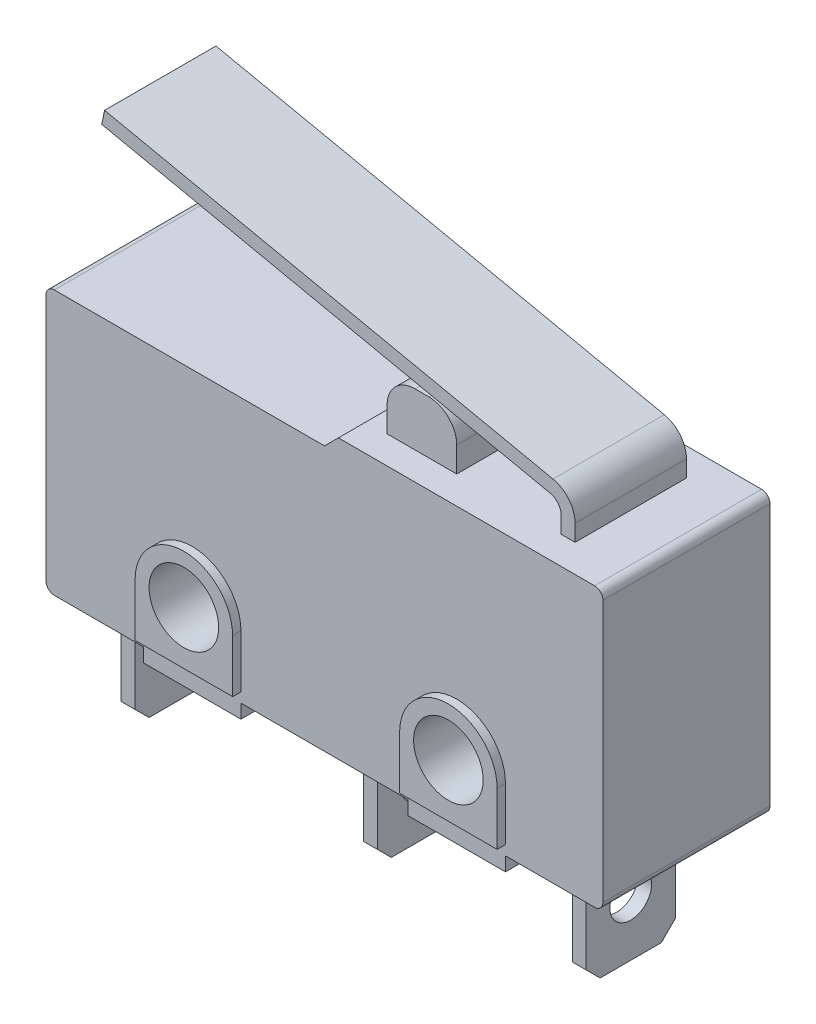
ISO-10303-21;
HEADER;
FILE_DESCRIPTION(('STEP AP214'),'2;1');
FILE_NAME('part.step','',(''),(''),'','','');
FILE_SCHEMA(('AUTOMOTIVE_DESIGN { 1 0 10303 214 1 1 1 1 }'));
ENDSEC;
DATA;
#1=APPLICATION_CONTEXT('core data for automotive mechanical design processes');
#2=APPLICATION_PROTOCOL_DEFINITION('international standard','automotive_design',2000,#1);
#3=PRODUCT_CONTEXT('',#1,'mechanical');
#4=PRODUCT('Part','Part','',(#3));
#5=PRODUCT_RELATED_PRODUCT_CATEGORY('part','',(#4));
#6=PRODUCT_DEFINITION_FORMATION('','',#4);
#7=PRODUCT_DEFINITION_CONTEXT('part definition',#1,'design');
#8=PRODUCT_DEFINITION('design','',#6,#7);
#9=PRODUCT_DEFINITION_SHAPE('','',#8);
#10=(LENGTH_UNIT() NAMED_UNIT(*) SI_UNIT(.MILLI.,.METRE.));
#11=(NAMED_UNIT(*) PLANE_ANGLE_UNIT() SI_UNIT($,.RADIAN.));
#12=(NAMED_UNIT(*) SI_UNIT($,.STERADIAN.) SOLID_ANGLE_UNIT());
#13=UNCERTAINTY_MEASURE_WITH_UNIT(LENGTH_MEASURE(1.E-05),#10,'distance_accuracy_value','');
#14=(GEOMETRIC_REPRESENTATION_CONTEXT(3) GLOBAL_UNCERTAINTY_ASSIGNED_CONTEXT((#13)) GLOBAL_UNIT_ASSIGNED_CONTEXT((#10,
#11,#12)) REPRESENTATION_CONTEXT('',''));
#15=CARTESIAN_POINT('',(0.,0.,0.));
#16=DIRECTION('',(0.,0.,1.));
#17=DIRECTION('',(1.,0.,0.));
#18=AXIS2_PLACEMENT_3D('',#15,#16,#17);
#19=CARTESIAN_POINT('',(3.75,7.15,-2.));
#20=DIRECTION('',(-1.,0.,0.));
#21=DIRECTION('',(0.,0.,1.));
#22=AXIS2_PLACEMENT_3D('',#19,#20,#21);
#23=PLANE('',#22);
#24=DIRECTION('',(0.,-1.,0.));
#25=VECTOR('',#24,1.);
#26=CARTESIAN_POINT('',(3.75,7.15,-2.));
#27=LINE('',#26,#25);
#28=CARTESIAN_POINT('',(3.75,6.15,-2.));
#29=VERTEX_POINT('',#28);
#30=CARTESIAN_POINT('',(3.75,5.25,-2.));
#31=VERTEX_POINT('',#30);
#32=EDGE_CURVE('E109',#29,#31,#27,.T.);
#33=ORIENTED_EDGE('',*,*,#32,.F.);
#34=DIRECTION('',(0.,0.,-1.));
#35=VECTOR('',#34,1.);
#36=CARTESIAN_POINT('',(3.75,6.15,2.));
#37=LINE('',#36,#35);
#38=CARTESIAN_POINT('',(3.75,6.15,2.));
#39=VERTEX_POINT('',#38);
#40=EDGE_CURVE('E80',#29,#39,#37,.F.);
#41=ORIENTED_EDGE('',*,*,#40,.T.);
#42=DIRECTION('',(0.,-1.,0.));
#43=VECTOR('',#42,1.);
#44=CARTESIAN_POINT('',(3.75,7.15,2.));
#45=LINE('',#44,#43);
#46=CARTESIAN_POINT('',(3.75,5.25,2.));
#47=VERTEX_POINT('',#46);
#48=EDGE_CURVE('E129',#39,#47,#45,.T.);
#49=ORIENTED_EDGE('',*,*,#48,.T.);
#50=DIRECTION('',(0.,0.,-1.));
#51=VECTOR('',#50,1.);
#52=CARTESIAN_POINT('',(3.75,5.25,-2.));
#53=LINE('',#52,#51);
#54=EDGE_CURVE('E125',#47,#31,#53,.T.);
#55=ORIENTED_EDGE('',*,*,#54,.T.);
#56=EDGE_LOOP('',(#33,#41,#49,#55));
#57=FACE_BOUND('',#56,.T.);
#58=ADVANCED_FACE('F57',(#57),#23,.F.);
#59=CARTESIAN_POINT('',(1.25,7.15,-2.));
#60=DIRECTION('',(0.,0.,1.));
#61=DIRECTION('',(1.,0.,0.));
#62=AXIS2_PLACEMENT_3D('',#59,#60,#61);
#63=PLANE('',#62);
#64=DIRECTION('',(-1.,0.,0.));
#65=VECTOR('',#64,1.);
#66=CARTESIAN_POINT('',(1.25,7.15,-2.));
#67=LINE('',#66,#65);
#68=CARTESIAN_POINT('',(2.75,7.15,-2.));
#69=VERTEX_POINT('',#68);
#70=CARTESIAN_POINT('',(2.25,7.15,-2.));
#71=VERTEX_POINT('',#70);
#72=EDGE_CURVE('E139',#69,#71,#67,.T.);
#73=ORIENTED_EDGE('',*,*,#72,.F.);
#74=CARTESIAN_POINT('',(2.75,6.15,-2.));
#75=DIRECTION('',(0.,0.,1.));
#76=DIRECTION('',(1.,0.,0.));
#77=AXIS2_PLACEMENT_3D('',#74,#75,#76);
#78=CIRCLE('',#77,1.);
#79=EDGE_CURVE('E116',#69,#29,#78,.F.);
#80=ORIENTED_EDGE('',*,*,#79,.T.);
#81=ORIENTED_EDGE('',*,*,#32,.T.);
#82=DIRECTION('',(-1.,0.,0.));
#83=VECTOR('',#82,1.);
#84=CARTESIAN_POINT('',(1.25,5.25,-2.));
#85=LINE('',#84,#83);
#86=CARTESIAN_POINT('',(1.25,5.25,-2.));
#87=VERTEX_POINT('',#86);
#88=EDGE_CURVE('E114',#31,#87,#85,.T.);
#89=ORIENTED_EDGE('',*,*,#88,.T.);
#90=DIRECTION('',(0.,-1.,0.));
#91=VECTOR('',#90,1.);
#92=CARTESIAN_POINT('',(1.25,7.15,-2.));
#93=LINE('',#92,#91);
#94=CARTESIAN_POINT('',(1.25,6.15,-2.));
#95=VERTEX_POINT('',#94);
#96=EDGE_CURVE('E119',#95,#87,#93,.T.);
#97=ORIENTED_EDGE('',*,*,#96,.F.);
#98=CARTESIAN_POINT('',(2.25,6.15,-2.));
#99=DIRECTION('',(0.,0.,1.));
#100=DIRECTION('',(1.,0.,0.));
#101=AXIS2_PLACEMENT_3D('',#98,#99,#100);
#102=CIRCLE('',#101,1.);
#103=EDGE_CURVE('E149',#95,#71,#102,.F.);
#104=ORIENTED_EDGE('',*,*,#103,.T.);
#105=EDGE_LOOP('',(#73,#80,#81,#89,#97,#104));
#106=FACE_BOUND('',#105,.T.);
#107=ADVANCED_FACE('F112',(#106),#63,.F.);
#108=CARTESIAN_POINT('',(1.25,7.15,-2.));
#109=DIRECTION('',(1.,0.,0.));
#110=DIRECTION('',(0.,0.,-1.));
#111=AXIS2_PLACEMENT_3D('',#108,#109,#110);
#112=PLANE('',#111);
#113=DIRECTION('',(0.,-1.,0.));
#114=VECTOR('',#113,1.);
#115=CARTESIAN_POINT('',(1.25,7.15,2.));
#116=LINE('',#115,#114);
#117=CARTESIAN_POINT('',(1.25,6.15,2.));
#118=VERTEX_POINT('',#117);
#119=CARTESIAN_POINT('',(1.25,5.25,2.));
#120=VERTEX_POINT('',#119);
#121=EDGE_CURVE('E141',#118,#120,#116,.T.);
#122=ORIENTED_EDGE('',*,*,#121,.F.);
#123=DIRECTION('',(0.,0.,1.));
#124=VECTOR('',#123,1.);
#125=CARTESIAN_POINT('',(1.25,6.15,-2.));
#126=LINE('',#125,#124);
#127=EDGE_CURVE('E12',#118,#95,#126,.F.);
#128=ORIENTED_EDGE('',*,*,#127,.T.);
#129=ORIENTED_EDGE('',*,*,#96,.T.);
#130=DIRECTION('',(0.,0.,1.));
#131=VECTOR('',#130,1.);
#132=CARTESIAN_POINT('',(1.25,5.25,-2.));
#133=LINE('',#132,#131);
#134=EDGE_CURVE('E127',#87,#120,#133,.T.);
#135=ORIENTED_EDGE('',*,*,#134,.T.);
#136=EDGE_LOOP('',(#122,#128,#129,#135));
#137=FACE_BOUND('',#136,.T.);
#138=ADVANCED_FACE('F175',(#137),#112,.F.);
#139=CARTESIAN_POINT('',(1.25,7.15,2.));
#140=DIRECTION('',(0.,0.,-1.));
#141=DIRECTION('',(-1.,0.,0.));
#142=AXIS2_PLACEMENT_3D('',#139,#140,#141);
#143=PLANE('',#142);
#144=ORIENTED_EDGE('',*,*,#48,.F.);
#145=CARTESIAN_POINT('',(2.75,6.15,2.));
#146=DIRECTION('',(0.,0.,-1.));
#147=DIRECTION('',(-1.,0.,0.));
#148=AXIS2_PLACEMENT_3D('',#145,#146,#147);
#149=CIRCLE('',#148,1.);
#150=CARTESIAN_POINT('',(2.75,7.15,2.));
#151=VERTEX_POINT('',#150);
#152=EDGE_CURVE('E65',#39,#151,#149,.F.);
#153=ORIENTED_EDGE('',*,*,#152,.T.);
#154=DIRECTION('',(1.,0.,0.));
#155=VECTOR('',#154,1.);
#156=CARTESIAN_POINT('',(1.25,7.15,2.));
#157=LINE('',#156,#155);
#158=CARTESIAN_POINT('',(2.25,7.15,2.));
#159=VERTEX_POINT('',#158);
#160=EDGE_CURVE('E133',#159,#151,#157,.T.);
#161=ORIENTED_EDGE('',*,*,#160,.F.);
#162=CARTESIAN_POINT('',(2.25,6.15,2.));
#163=DIRECTION('',(0.,0.,-1.));
#164=DIRECTION('',(-1.,0.,0.));
#165=AXIS2_PLACEMENT_3D('',#162,#163,#164);
#166=CIRCLE('',#165,1.);
#167=EDGE_CURVE('E72',#159,#118,#166,.F.);
#168=ORIENTED_EDGE('',*,*,#167,.T.);
#169=ORIENTED_EDGE('',*,*,#121,.T.);
#170=DIRECTION('',(1.,0.,0.));
#171=VECTOR('',#170,1.);
#172=CARTESIAN_POINT('',(1.25,5.25,2.));
#173=LINE('',#172,#171);
#174=EDGE_CURVE('E137',#120,#47,#173,.T.);
#175=ORIENTED_EDGE('',*,*,#174,.T.);
#176=EDGE_LOOP('',(#144,#153,#161,#168,#169,#175));
#177=FACE_BOUND('',#176,.T.);
#178=ADVANCED_FACE('F155',(#177),#143,.F.);
#179=CARTESIAN_POINT('',(0.,7.15,0.));
#180=DIRECTION('',(0.,1.,0.));
#181=DIRECTION('',(0.,0.,1.));
#182=AXIS2_PLACEMENT_3D('',#179,#180,#181);
#183=PLANE('',#182);
#184=ORIENTED_EDGE('',*,*,#160,.T.);
#185=DIRECTION('',(0.,0.,-1.));
#186=VECTOR('',#185,1.);
#187=CARTESIAN_POINT('',(2.75,7.15,-2.));
#188=LINE('',#187,#186);
#189=EDGE_CURVE('E146',#151,#69,#188,.T.);
#190=ORIENTED_EDGE('',*,*,#189,.T.);
#191=ORIENTED_EDGE('',*,*,#72,.T.);
#192=DIRECTION('',(0.,0.,1.));
#193=VECTOR('',#192,1.);
#194=CARTESIAN_POINT('',(2.25,7.15,2.));
#195=LINE('',#194,#193);
#196=EDGE_CURVE('E118',#71,#159,#195,.T.);
#197=ORIENTED_EDGE('',*,*,#196,.T.);
#198=EDGE_LOOP('',(#184,#190,#191,#197));
#199=FACE_BOUND('',#198,.T.);
#200=ADVANCED_FACE('F159',(#199),#183,.T.);
#201=CARTESIAN_POINT('',(0.,5.25,0.));
#202=DIRECTION('',(0.,1.,0.));
#203=DIRECTION('',(0.,0.,1.));
#204=AXIS2_PLACEMENT_3D('',#201,#202,#203);
#205=PLANE('',#204);
#206=ORIENTED_EDGE('',*,*,#54,.F.);
#207=ORIENTED_EDGE('',*,*,#174,.F.);
#208=ORIENTED_EDGE('',*,*,#134,.F.);
#209=ORIENTED_EDGE('',*,*,#88,.F.);
#210=EDGE_LOOP('',(#206,#207,#208,#209));
#211=FACE_BOUND('',#210,.T.);
#212=ADVANCED_FACE('F123',(#211),#205,.F.);
#213=CARTESIAN_POINT('',(2.75,6.15,0.));
#214=DIRECTION('',(0.,0.,1.));
#215=DIRECTION('',(1.,0.,0.));
#216=AXIS2_PLACEMENT_3D('',#213,#214,#215);
#217=CYLINDRICAL_SURFACE('',#216,1.);
#218=ORIENTED_EDGE('',*,*,#152,.F.);
#219=ORIENTED_EDGE('',*,*,#40,.F.);
#220=ORIENTED_EDGE('',*,*,#79,.F.);
#221=ORIENTED_EDGE('',*,*,#189,.F.);
#222=EDGE_LOOP('',(#218,#219,#220,#221));
#223=FACE_BOUND('',#222,.T.);
#224=ADVANCED_FACE('F162',(#223),#217,.T.);
#225=CARTESIAN_POINT('',(2.25,6.15,0.));
#226=DIRECTION('',(0.,0.,-1.));
#227=DIRECTION('',(-1.,0.,0.));
#228=AXIS2_PLACEMENT_3D('',#225,#226,#227);
#229=CYLINDRICAL_SURFACE('',#228,1.);
#230=ORIENTED_EDGE('',*,*,#103,.F.);
#231=ORIENTED_EDGE('',*,*,#127,.F.);
#232=ORIENTED_EDGE('',*,*,#167,.F.);
#233=ORIENTED_EDGE('',*,*,#196,.F.);
#234=EDGE_LOOP('',(#230,#231,#232,#233));
#235=FACE_BOUND('',#234,.T.);
#236=ADVANCED_FACE('F59',(#235),#229,.T.);
#237=CLOSED_SHELL('',(#58,#107,#138,#178,#200,#212,#224,#236));
#238=MANIFOLD_SOLID_BREP('B2',#237);
#239=CARTESIAN_POINT('',(0.,0.,3.));
#240=DIRECTION('',(0.,0.,-1.));
#241=DIRECTION('',(-1.,0.,0.));
#242=AXIS2_PLACEMENT_3D('',#239,#240,#241);
#243=PLANE('',#242);
#244=DIRECTION('',(1.,0.,0.));
#245=VECTOR('',#244,1.);
#246=CARTESIAN_POINT('',(6.5,-4.4,3.));
#247=LINE('',#246,#245);
#248=CARTESIAN_POINT('',(3.,-4.4,3.));
#249=VERTEX_POINT('',#248);
#250=CARTESIAN_POINT('',(6.5,-4.4,3.));
#251=VERTEX_POINT('',#250);
#252=EDGE_CURVE('E842',#249,#251,#247,.T.);
#253=ORIENTED_EDGE('',*,*,#252,.F.);
#254=DIRECTION('',(0.,-1.,0.));
#255=VECTOR('',#254,1.);
#256=CARTESIAN_POINT('',(3.,-4.4,3.));
#257=LINE('',#256,#255);
#258=CARTESIAN_POINT('',(3.,-2.5,3.));
#259=VERTEX_POINT('',#258);
#260=EDGE_CURVE('E832',#259,#249,#257,.T.);
#261=ORIENTED_EDGE('',*,*,#260,.F.);
#262=CARTESIAN_POINT('',(4.75,-2.5,3.));
#263=DIRECTION('',(0.,0.,1.));
#264=DIRECTION('',(-1.,0.,0.));
#265=AXIS2_PLACEMENT_3D('',#262,#263,#264);
#266=CIRCLE('',#265,1.75);
#267=CARTESIAN_POINT('',(6.5,-2.5,3.));
#268=VERTEX_POINT('',#267);
#269=EDGE_CURVE('E835',#268,#259,#266,.T.);
#270=ORIENTED_EDGE('',*,*,#269,.F.);
#271=DIRECTION('',(0.,1.,0.));
#272=VECTOR('',#271,1.);
#273=CARTESIAN_POINT('',(6.5,-2.5,3.));
#274=LINE('',#273,#272);
#275=EDGE_CURVE('E839',#251,#268,#274,.T.);
#276=ORIENTED_EDGE('',*,*,#275,.F.);
#277=EDGE_LOOP('',(#253,#261,#270,#276));
#278=FACE_BOUND('',#277,.T.);
#279=DIRECTION('',(0.,-1.,0.));
#280=VECTOR('',#279,1.);
#281=CARTESIAN_POINT('',(-10.,5.25,3.));
#282=LINE('',#281,#280);
#283=CARTESIAN_POINT('',(-10.,4.45,3.));
#284=VERTEX_POINT('',#283);
#285=CARTESIAN_POINT('',(-10.,-4.45,3.));
#286=VERTEX_POINT('',#285);
#287=EDGE_CURVE('E1012',#284,#286,#282,.T.);
#288=ORIENTED_EDGE('',*,*,#287,.T.);
#289=CARTESIAN_POINT('',(-9.7,-4.45,3.));
#290=DIRECTION('',(0.,0.,-1.));
#291=DIRECTION('',(-1.,0.,0.));
#292=AXIS2_PLACEMENT_3D('',#289,#290,#291);
#293=CIRCLE('',#292,0.3);
#294=CARTESIAN_POINT('',(-9.7,-4.75,3.));
#295=VERTEX_POINT('',#294);
#296=EDGE_CURVE('E1111',#286,#295,#293,.F.);
#297=ORIENTED_EDGE('',*,*,#296,.T.);
#298=DIRECTION('',(-1.,0.,0.));
#299=VECTOR('',#298,1.);
#300=CARTESIAN_POINT('',(-10.,-4.75,3.));
#301=LINE('',#300,#299);
#302=CARTESIAN_POINT('',(-6.5,-4.75,3.));
#303=VERTEX_POINT('',#302);
#304=EDGE_CURVE('E994',#303,#295,#301,.T.);
#305=ORIENTED_EDGE('',*,*,#304,.F.);
#306=DIRECTION('',(0.,1.,0.));
#307=VECTOR('',#306,1.);
#308=CARTESIAN_POINT('',(-6.5,-5.25,3.));
#309=LINE('',#308,#307);
#310=CARTESIAN_POINT('',(-6.5,-5.25,3.));
#311=VERTEX_POINT('',#310);
#312=EDGE_CURVE('E967',#311,#303,#309,.T.);
#313=ORIENTED_EDGE('',*,*,#312,.F.);
#314=DIRECTION('',(1.,0.,0.));
#315=VECTOR('',#314,1.);
#316=CARTESIAN_POINT('',(10.,-5.25,3.));
#317=LINE('',#316,#315);
#318=CARTESIAN_POINT('',(-3.,-5.25,3.));
#319=VERTEX_POINT('',#318);
#320=EDGE_CURVE('E1019',#311,#319,#317,.T.);
#321=ORIENTED_EDGE('',*,*,#320,.T.);
#322=DIRECTION('',(0.,-1.,0.));
#323=VECTOR('',#322,1.);
#324=CARTESIAN_POINT('',(-3.,-5.25,3.));
#325=LINE('',#324,#323);
#326=CARTESIAN_POINT('',(-3.,-4.75,3.));
#327=VERTEX_POINT('',#326);
#328=EDGE_CURVE('E951',#327,#319,#325,.T.);
#329=ORIENTED_EDGE('',*,*,#328,.F.);
#330=DIRECTION('',(-1.,0.,0.));
#331=VECTOR('',#330,1.);
#332=CARTESIAN_POINT('',(-3.,-4.75,3.));
#333=LINE('',#332,#331);
#334=CARTESIAN_POINT('',(3.,-4.75,3.));
#335=VERTEX_POINT('',#334);
#336=EDGE_CURVE('E976',#335,#327,#333,.T.);
#337=ORIENTED_EDGE('',*,*,#336,.F.);
#338=DIRECTION('',(0.,1.,0.));
#339=VECTOR('',#338,1.);
#340=CARTESIAN_POINT('',(3.,-5.25,3.));
#341=LINE('',#340,#339);
#342=CARTESIAN_POINT('',(3.,-5.25,3.));
#343=VERTEX_POINT('',#342);
#344=EDGE_CURVE('E979',#343,#335,#341,.T.);
#345=ORIENTED_EDGE('',*,*,#344,.F.);
#346=CARTESIAN_POINT('',(6.5,-5.25,3.));
#347=VERTEX_POINT('',#346);
#348=EDGE_CURVE('E1015',#343,#347,#317,.T.);
#349=ORIENTED_EDGE('',*,*,#348,.T.);
#350=DIRECTION('',(0.,-1.,0.));
#351=VECTOR('',#350,1.);
#352=CARTESIAN_POINT('',(6.5,-5.25,3.));
#353=LINE('',#352,#351);
#354=CARTESIAN_POINT('',(6.5,-4.75,3.));
#355=VERTEX_POINT('',#354);
#356=EDGE_CURVE('E1009',#355,#347,#353,.T.);
#357=ORIENTED_EDGE('',*,*,#356,.F.);
#358=DIRECTION('',(-1.,0.,0.));
#359=VECTOR('',#358,1.);
#360=CARTESIAN_POINT('',(10.,-4.75,3.));
#361=LINE('',#360,#359);
#362=CARTESIAN_POINT('',(9.7,-4.75,3.));
#363=VERTEX_POINT('',#362);
#364=EDGE_CURVE('E988',#363,#355,#361,.T.);
#365=ORIENTED_EDGE('',*,*,#364,.F.);
#366=CARTESIAN_POINT('',(9.7,-4.45,3.));
#367=DIRECTION('',(0.,0.,-1.));
#368=DIRECTION('',(-1.,0.,0.));
#369=AXIS2_PLACEMENT_3D('',#366,#367,#368);
#370=CIRCLE('',#369,0.3);
#371=CARTESIAN_POINT('',(10.,-4.45,3.));
#372=VERTEX_POINT('',#371);
#373=EDGE_CURVE('E1109',#363,#372,#370,.F.);
#374=ORIENTED_EDGE('',*,*,#373,.T.);
#375=DIRECTION('',(0.,1.,0.));
#376=VECTOR('',#375,1.);
#377=CARTESIAN_POINT('',(10.,5.25,3.));
#378=LINE('',#377,#376);
#379=CARTESIAN_POINT('',(10.,4.95,3.));
#380=VERTEX_POINT('',#379);
#381=EDGE_CURVE('E1020',#372,#380,#378,.T.);
#382=ORIENTED_EDGE('',*,*,#381,.T.);
#383=CARTESIAN_POINT('',(9.7,4.95,3.));
#384=DIRECTION('',(0.,0.,-1.));
#385=DIRECTION('',(-1.,0.,0.));
#386=AXIS2_PLACEMENT_3D('',#383,#384,#385);
#387=CIRCLE('',#386,0.3);
#388=CARTESIAN_POINT('',(9.7,5.25,3.));
#389=VERTEX_POINT('',#388);
#390=EDGE_CURVE('E1107',#380,#389,#387,.F.);
#391=ORIENTED_EDGE('',*,*,#390,.T.);
#392=DIRECTION('',(-1.,0.,0.));
#393=VECTOR('',#392,1.);
#394=CARTESIAN_POINT('',(10.,5.25,3.));
#395=LINE('',#394,#393);
#396=CARTESIAN_POINT('',(0.500000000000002,5.25,3.));
#397=VERTEX_POINT('',#396);
#398=EDGE_CURVE('E1023',#389,#397,#395,.T.);
#399=ORIENTED_EDGE('',*,*,#398,.T.);
#400=DIRECTION('',(0.707106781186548,0.707106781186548,0.));
#401=VECTOR('',#400,1.);
#402=CARTESIAN_POINT('',(0.500000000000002,5.25,3.));
#403=LINE('',#402,#401);
#404=CARTESIAN_POINT('',(0.,4.75,3.));
#405=VERTEX_POINT('',#404);
#406=EDGE_CURVE('E1094',#397,#405,#403,.F.);
#407=ORIENTED_EDGE('',*,*,#406,.T.);
#408=DIRECTION('',(1.,0.,0.));
#409=VECTOR('',#408,1.);
#410=CARTESIAN_POINT('',(0.,4.75,3.));
#411=LINE('',#410,#409);
#412=CARTESIAN_POINT('',(-9.7,4.75,3.));
#413=VERTEX_POINT('',#412);
#414=EDGE_CURVE('E948',#413,#405,#411,.T.);
#415=ORIENTED_EDGE('',*,*,#414,.F.);
#416=CARTESIAN_POINT('',(-9.7,4.45,3.));
#417=DIRECTION('',(0.,0.,-1.));
#418=DIRECTION('',(-1.,0.,0.));
#419=AXIS2_PLACEMENT_3D('',#416,#417,#418);
#420=CIRCLE('',#419,0.3);
#421=EDGE_CURVE('E1105',#413,#284,#420,.F.);
#422=ORIENTED_EDGE('',*,*,#421,.T.);
#423=EDGE_LOOP('',(#288,#297,#305,#313,#321,#329,#337,#345,#349,#357,#365,#374,#382,#391,#399,
#407,#415,#422));
#424=FACE_BOUND('',#423,.T.);
#425=CARTESIAN_POINT('',(-4.75,-2.5,3.));
#426=DIRECTION('',(0.,0.,1.));
#427=DIRECTION('',(1.,0.,0.));
#428=AXIS2_PLACEMENT_3D('',#425,#426,#427);
#429=CIRCLE('',#428,1.75);
#430=CARTESIAN_POINT('',(-3.,-2.5,3.));
#431=VERTEX_POINT('',#430);
#432=CARTESIAN_POINT('',(-6.5,-2.5,3.));
#433=VERTEX_POINT('',#432);
#434=EDGE_CURVE('E785',#431,#433,#429,.T.);
#435=ORIENTED_EDGE('',*,*,#434,.F.);
#436=DIRECTION('',(0.,1.,0.));
#437=VECTOR('',#436,1.);
#438=CARTESIAN_POINT('',(-3.,-4.4,3.));
#439=LINE('',#438,#437);
#440=CARTESIAN_POINT('',(-3.,-4.4,3.));
#441=VERTEX_POINT('',#440);
#442=EDGE_CURVE('E791',#441,#431,#439,.T.);
#443=ORIENTED_EDGE('',*,*,#442,.F.);
#444=DIRECTION('',(1.,0.,0.));
#445=VECTOR('',#444,1.);
#446=CARTESIAN_POINT('',(-6.5,-4.4,3.));
#447=LINE('',#446,#445);
#448=CARTESIAN_POINT('',(-6.5,-4.4,3.));
#449=VERTEX_POINT('',#448);
#450=EDGE_CURVE('E803',#449,#441,#447,.T.);
#451=ORIENTED_EDGE('',*,*,#450,.F.);
#452=DIRECTION('',(0.,-1.,0.));
#453=VECTOR('',#452,1.);
#454=CARTESIAN_POINT('',(-6.5,-2.5,3.));
#455=LINE('',#454,#453);
#456=EDGE_CURVE('E800',#433,#449,#455,.T.);
#457=ORIENTED_EDGE('',*,*,#456,.F.);
#458=EDGE_LOOP('',(#435,#443,#451,#457));
#459=FACE_BOUND('',#458,.T.);
#460=ADVANCED_FACE('F265',(#278,#424,#459),#243,.F.);
#461=CARTESIAN_POINT('',(10.,-4.75,-3.));
#462=DIRECTION('',(0.,1.,0.));
#463=DIRECTION('',(-1.,0.,0.));
#464=AXIS2_PLACEMENT_3D('',#461,#462,#463);
#465=PLANE('',#464);
#466=DIRECTION('',(-1.,0.,0.));
#467=VECTOR('',#466,1.);
#468=CARTESIAN_POINT('',(10.,-4.75,-3.));
#469=LINE('',#468,#467);
#470=CARTESIAN_POINT('',(9.7,-4.75,-3.));
#471=VERTEX_POINT('',#470);
#472=CARTESIAN_POINT('',(6.5,-4.75,-3.));
#473=VERTEX_POINT('',#472);
#474=EDGE_CURVE('E1007',#471,#473,#469,.T.);
#475=ORIENTED_EDGE('',*,*,#474,.F.);
#476=DIRECTION('',(0.,0.,1.));
#477=VECTOR('',#476,1.);
#478=CARTESIAN_POINT('',(9.7,-4.75,-3.));
#479=LINE('',#478,#477);
#480=EDGE_CURVE('E1123',#471,#363,#479,.T.);
#481=ORIENTED_EDGE('',*,*,#480,.T.);
#482=ORIENTED_EDGE('',*,*,#364,.T.);
#483=DIRECTION('',(0.,0.,1.));
#484=VECTOR('',#483,1.);
#485=CARTESIAN_POINT('',(6.5,-4.75,-3.));
#486=LINE('',#485,#484);
#487=EDGE_CURVE('E999',#473,#355,#486,.T.);
#488=ORIENTED_EDGE('',*,*,#487,.F.);
#489=EDGE_LOOP('',(#475,#481,#482,#488));
#490=FACE_BOUND('',#489,.T.);
#491=DIRECTION('',(0.,0.,1.));
#492=VECTOR('',#491,1.);
#493=CARTESIAN_POINT('',(7.5,-4.75,1.6));
#494=LINE('',#493,#492);
#495=CARTESIAN_POINT('',(7.5,-4.75,1.6));
#496=VERTEX_POINT('',#495);
#497=CARTESIAN_POINT('',(7.5,-4.75,-1.6));
#498=VERTEX_POINT('',#497);
#499=EDGE_CURVE('E869',#496,#498,#494,.F.);
#500=ORIENTED_EDGE('',*,*,#499,.F.);
#501=DIRECTION('',(1.,0.,0.));
#502=VECTOR('',#501,1.);
#503=CARTESIAN_POINT('',(7.5,-4.75,1.6));
#504=LINE('',#503,#502);
#505=CARTESIAN_POINT('',(8.,-4.75,1.6));
#506=VERTEX_POINT('',#505);
#507=EDGE_CURVE('E928',#496,#506,#504,.T.);
#508=ORIENTED_EDGE('',*,*,#507,.T.);
#509=DIRECTION('',(0.,0.,-1.));
#510=VECTOR('',#509,1.);
#511=CARTESIAN_POINT('',(8.,-4.75,1.6));
#512=LINE('',#511,#510);
#513=CARTESIAN_POINT('',(8.,-4.75,-1.6));
#514=VERTEX_POINT('',#513);
#515=EDGE_CURVE('E937',#506,#514,#512,.T.);
#516=ORIENTED_EDGE('',*,*,#515,.T.);
#517=DIRECTION('',(-1.,0.,0.));
#518=VECTOR('',#517,1.);
#519=CARTESIAN_POINT('',(8.,-4.75,-1.6));
#520=LINE('',#519,#518);
#521=EDGE_CURVE('E934',#514,#498,#520,.T.);
#522=ORIENTED_EDGE('',*,*,#521,.T.);
#523=EDGE_LOOP('',(#500,#508,#516,#522));
#524=FACE_BOUND('',#523,.T.);
#525=ADVANCED_FACE('F1163',(#490,#524),#465,.F.);
#526=CARTESIAN_POINT('',(-10.,-4.75,-3.));
#527=DIRECTION('',(0.,1.,0.));
#528=DIRECTION('',(-1.,0.,0.));
#529=AXIS2_PLACEMENT_3D('',#526,#527,#528);
#530=PLANE('',#529);
#531=ORIENTED_EDGE('',*,*,#304,.T.);
#532=DIRECTION('',(0.,0.,1.));
#533=VECTOR('',#532,1.);
#534=CARTESIAN_POINT('',(-9.7,-4.75,-3.));
#535=LINE('',#534,#533);
#536=CARTESIAN_POINT('',(-9.7,-4.75,-3.));
#537=VERTEX_POINT('',#536);
#538=EDGE_CURVE('E1113',#295,#537,#535,.F.);
#539=ORIENTED_EDGE('',*,*,#538,.T.);
#540=DIRECTION('',(-1.,0.,0.));
#541=VECTOR('',#540,1.);
#542=CARTESIAN_POINT('',(-10.,-4.75,-3.));
#543=LINE('',#542,#541);
#544=CARTESIAN_POINT('',(-6.5,-4.75,-3.));
#545=VERTEX_POINT('',#544);
#546=EDGE_CURVE('E985',#545,#537,#543,.T.);
#547=ORIENTED_EDGE('',*,*,#546,.F.);
#548=DIRECTION('',(0.,0.,1.));
#549=VECTOR('',#548,1.);
#550=CARTESIAN_POINT('',(-6.5,-4.75,-3.));
#551=LINE('',#550,#549);
#552=EDGE_CURVE('E986',#545,#303,#551,.T.);
#553=ORIENTED_EDGE('',*,*,#552,.T.);
#554=EDGE_LOOP('',(#531,#539,#547,#553));
#555=FACE_BOUND('',#554,.T.);
#556=DIRECTION('',(0.,0.,1.));
#557=VECTOR('',#556,1.);
#558=CARTESIAN_POINT('',(-8.7,-4.75,1.6));
#559=LINE('',#558,#557);
#560=CARTESIAN_POINT('',(-8.7,-4.75,1.6));
#561=VERTEX_POINT('',#560);
#562=CARTESIAN_POINT('',(-8.7,-4.75,-1.6));
#563=VERTEX_POINT('',#562);
#564=EDGE_CURVE('E878',#561,#563,#559,.F.);
#565=ORIENTED_EDGE('',*,*,#564,.F.);
#566=DIRECTION('',(1.,0.,0.));
#567=VECTOR('',#566,1.);
#568=CARTESIAN_POINT('',(-8.7,-4.75,1.6));
#569=LINE('',#568,#567);
#570=CARTESIAN_POINT('',(-8.2,-4.75,1.6));
#571=VERTEX_POINT('',#570);
#572=EDGE_CURVE('E874',#561,#571,#569,.T.);
#573=ORIENTED_EDGE('',*,*,#572,.T.);
#574=DIRECTION('',(0.,0.,-1.));
#575=VECTOR('',#574,1.);
#576=CARTESIAN_POINT('',(-8.2,-4.75,1.6));
#577=LINE('',#576,#575);
#578=CARTESIAN_POINT('',(-8.2,-4.75,-1.6));
#579=VERTEX_POINT('',#578);
#580=EDGE_CURVE('E885',#571,#579,#577,.T.);
#581=ORIENTED_EDGE('',*,*,#580,.T.);
#582=DIRECTION('',(-1.,0.,0.));
#583=VECTOR('',#582,1.);
#584=CARTESIAN_POINT('',(-8.2,-4.75,-1.6));
#585=LINE('',#584,#583);
#586=EDGE_CURVE('E881',#579,#563,#585,.T.);
#587=ORIENTED_EDGE('',*,*,#586,.T.);
#588=EDGE_LOOP('',(#565,#573,#581,#587));
#589=FACE_BOUND('',#588,.T.);
#590=ADVANCED_FACE('F1201',(#555,#589),#530,.F.);
#591=CARTESIAN_POINT('',(-3.,-4.75,-3.));
#592=DIRECTION('',(0.,1.,0.));
#593=DIRECTION('',(-1.,0.,0.));
#594=AXIS2_PLACEMENT_3D('',#591,#592,#593);
#595=PLANE('',#594);
#596=DIRECTION('',(0.,0.,1.));
#597=VECTOR('',#596,1.);
#598=CARTESIAN_POINT('',(-3.,-4.75,-3.));
#599=LINE('',#598,#597);
#600=CARTESIAN_POINT('',(-3.,-4.75,-3.));
#601=VERTEX_POINT('',#600);
#602=EDGE_CURVE('E965',#601,#327,#599,.T.);
#603=ORIENTED_EDGE('',*,*,#602,.F.);
#604=DIRECTION('',(-1.,0.,0.));
#605=VECTOR('',#604,1.);
#606=CARTESIAN_POINT('',(-3.,-4.75,-3.));
#607=LINE('',#606,#605);
#608=CARTESIAN_POINT('',(3.,-4.75,-3.));
#609=VERTEX_POINT('',#608);
#610=EDGE_CURVE('E960',#609,#601,#607,.T.);
#611=ORIENTED_EDGE('',*,*,#610,.F.);
#612=DIRECTION('',(0.,0.,1.));
#613=VECTOR('',#612,1.);
#614=CARTESIAN_POINT('',(3.,-4.75,-3.));
#615=LINE('',#614,#613);
#616=EDGE_CURVE('E963',#609,#335,#615,.T.);
#617=ORIENTED_EDGE('',*,*,#616,.T.);
#618=ORIENTED_EDGE('',*,*,#336,.T.);
#619=EDGE_LOOP('',(#603,#611,#617,#618));
#620=FACE_BOUND('',#619,.T.);
#621=DIRECTION('',(0.,0.,1.));
#622=VECTOR('',#621,1.);
#623=CARTESIAN_POINT('',(0.,-4.75,1.6));
#624=LINE('',#623,#622);
#625=CARTESIAN_POINT('',(0.,-4.75,1.6));
#626=VERTEX_POINT('',#625);
#627=CARTESIAN_POINT('',(0.,-4.75,-1.6));
#628=VERTEX_POINT('',#627);
#629=EDGE_CURVE('E906',#626,#628,#624,.F.);
#630=ORIENTED_EDGE('',*,*,#629,.F.);
#631=DIRECTION('',(1.,0.,0.));
#632=VECTOR('',#631,1.);
#633=CARTESIAN_POINT('',(0.,-4.75,1.6));
#634=LINE('',#633,#632);
#635=CARTESIAN_POINT('',(0.500000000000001,-4.75,1.6));
#636=VERTEX_POINT('',#635);
#637=EDGE_CURVE('E902',#626,#636,#634,.T.);
#638=ORIENTED_EDGE('',*,*,#637,.T.);
#639=DIRECTION('',(0.,0.,-1.));
#640=VECTOR('',#639,1.);
#641=CARTESIAN_POINT('',(0.500000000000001,-4.75,1.6));
#642=LINE('',#641,#640);
#643=CARTESIAN_POINT('',(0.500000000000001,-4.75,-1.6));
#644=VERTEX_POINT('',#643);
#645=EDGE_CURVE('E913',#636,#644,#642,.T.);
#646=ORIENTED_EDGE('',*,*,#645,.T.);
#647=DIRECTION('',(-1.,0.,0.));
#648=VECTOR('',#647,1.);
#649=CARTESIAN_POINT('',(0.500000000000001,-4.75,-1.6));
#650=LINE('',#649,#648);
#651=EDGE_CURVE('E909',#644,#628,#650,.T.);
#652=ORIENTED_EDGE('',*,*,#651,.T.);
#653=EDGE_LOOP('',(#630,#638,#646,#652));
#654=FACE_BOUND('',#653,.T.);
#655=ADVANCED_FACE('F1181',(#620,#654),#595,.F.);
#656=CARTESIAN_POINT('',(10.,-5.25,3.));
#657=DIRECTION('',(0.,1.,0.));
#658=DIRECTION('',(-1.,0.,0.));
#659=AXIS2_PLACEMENT_3D('',#656,#657,#658);
#660=PLANE('',#659);
#661=DIRECTION('',(1.,0.,0.));
#662=VECTOR('',#661,1.);
#663=CARTESIAN_POINT('',(10.,-5.25,-3.));
#664=LINE('',#663,#662);
#665=CARTESIAN_POINT('',(-6.5,-5.25,-3.));
#666=VERTEX_POINT('',#665);
#667=CARTESIAN_POINT('',(-3.,-5.25,-3.));
#668=VERTEX_POINT('',#667);
#669=EDGE_CURVE('E1031',#666,#668,#664,.T.);
#670=ORIENTED_EDGE('',*,*,#669,.T.);
#671=DIRECTION('',(0.,0.,1.));
#672=VECTOR('',#671,1.);
#673=CARTESIAN_POINT('',(-3.,-5.25,-3.));
#674=LINE('',#673,#672);
#675=EDGE_CURVE('E957',#668,#319,#674,.T.);
#676=ORIENTED_EDGE('',*,*,#675,.T.);
#677=ORIENTED_EDGE('',*,*,#320,.F.);
#678=DIRECTION('',(0.,0.,1.));
#679=VECTOR('',#678,1.);
#680=CARTESIAN_POINT('',(-6.5,-5.25,-3.));
#681=LINE('',#680,#679);
#682=EDGE_CURVE('E983',#666,#311,#681,.T.);
#683=ORIENTED_EDGE('',*,*,#682,.F.);
#684=EDGE_LOOP('',(#670,#676,#677,#683));
#685=FACE_BOUND('',#684,.T.);
#686=ADVANCED_FACE('F1191',(#685),#660,.F.);
#687=CARTESIAN_POINT('',(-10.,5.25,3.));
#688=DIRECTION('',(1.,0.,0.));
#689=DIRECTION('',(0.,1.,0.));
#690=AXIS2_PLACEMENT_3D('',#687,#688,#689);
#691=PLANE('',#690);
#692=DIRECTION('',(0.,-1.,0.));
#693=VECTOR('',#692,1.);
#694=CARTESIAN_POINT('',(-10.,5.25,-3.));
#695=LINE('',#694,#693);
#696=CARTESIAN_POINT('',(-10.,4.45,-3.));
#697=VERTEX_POINT('',#696);
#698=CARTESIAN_POINT('',(-10.,-4.45,-3.));
#699=VERTEX_POINT('',#698);
#700=EDGE_CURVE('E956',#697,#699,#695,.T.);
#701=ORIENTED_EDGE('',*,*,#700,.T.);
#702=DIRECTION('',(0.,0.,1.));
#703=VECTOR('',#702,1.);
#704=CARTESIAN_POINT('',(-10.,-4.45,3.));
#705=LINE('',#704,#703);
#706=EDGE_CURVE('E1102',#699,#286,#705,.T.);
#707=ORIENTED_EDGE('',*,*,#706,.T.);
#708=ORIENTED_EDGE('',*,*,#287,.F.);
#709=DIRECTION('',(0.,0.,1.));
#710=VECTOR('',#709,1.);
#711=CARTESIAN_POINT('',(-10.,4.45,3.));
#712=LINE('',#711,#710);
#713=EDGE_CURVE('E1100',#284,#697,#712,.F.);
#714=ORIENTED_EDGE('',*,*,#713,.T.);
#715=EDGE_LOOP('',(#701,#707,#708,#714));
#716=FACE_BOUND('',#715,.T.);
#717=ADVANCED_FACE('F1210',(#716),#691,.F.);
#718=ORIENTED_EDGE('',*,*,#348,.F.);
#719=DIRECTION('',(0.,0.,1.));
#720=VECTOR('',#719,1.);
#721=CARTESIAN_POINT('',(3.,-5.25,-3.));
#722=LINE('',#721,#720);
#723=CARTESIAN_POINT('',(3.,-5.25,-3.));
#724=VERTEX_POINT('',#723);
#725=EDGE_CURVE('E961',#724,#343,#722,.T.);
#726=ORIENTED_EDGE('',*,*,#725,.F.);
#727=CARTESIAN_POINT('',(6.5,-5.25,-3.));
#728=VERTEX_POINT('',#727);
#729=EDGE_CURVE('E1028',#724,#728,#664,.T.);
#730=ORIENTED_EDGE('',*,*,#729,.T.);
#731=DIRECTION('',(0.,0.,1.));
#732=VECTOR('',#731,1.);
#733=CARTESIAN_POINT('',(6.5,-5.25,-3.));
#734=LINE('',#733,#732);
#735=EDGE_CURVE('E897',#728,#347,#734,.T.);
#736=ORIENTED_EDGE('',*,*,#735,.T.);
#737=EDGE_LOOP('',(#718,#726,#730,#736));
#738=FACE_BOUND('',#737,.T.);
#739=ADVANCED_FACE('F1173',(#738),#660,.F.);
#740=CARTESIAN_POINT('',(10.,5.25,3.));
#741=DIRECTION('',(-1.,0.,0.));
#742=DIRECTION('',(0.,0.,1.));
#743=AXIS2_PLACEMENT_3D('',#740,#741,#742);
#744=PLANE('',#743);
#745=ORIENTED_EDGE('',*,*,#381,.F.);
#746=DIRECTION('',(0.,0.,1.));
#747=VECTOR('',#746,1.);
#748=CARTESIAN_POINT('',(10.,-4.45,3.));
#749=LINE('',#748,#747);
#750=CARTESIAN_POINT('',(10.,-4.45,-3.));
#751=VERTEX_POINT('',#750);
#752=EDGE_CURVE('E1128',#372,#751,#749,.F.);
#753=ORIENTED_EDGE('',*,*,#752,.T.);
#754=DIRECTION('',(0.,1.,0.));
#755=VECTOR('',#754,1.);
#756=CARTESIAN_POINT('',(10.,5.25,-3.));
#757=LINE('',#756,#755);
#758=CARTESIAN_POINT('',(10.,4.95,-3.));
#759=VERTEX_POINT('',#758);
#760=EDGE_CURVE('E1032',#751,#759,#757,.T.);
#761=ORIENTED_EDGE('',*,*,#760,.T.);
#762=DIRECTION('',(0.,0.,-1.));
#763=VECTOR('',#762,1.);
#764=CARTESIAN_POINT('',(10.,4.95,3.));
#765=LINE('',#764,#763);
#766=EDGE_CURVE('E1126',#759,#380,#765,.F.);
#767=ORIENTED_EDGE('',*,*,#766,.T.);
#768=EDGE_LOOP('',(#745,#753,#761,#767));
#769=FACE_BOUND('',#768,.T.);
#770=ADVANCED_FACE('F1154',(#769),#744,.F.);
#771=CARTESIAN_POINT('',(10.,5.25,3.));
#772=DIRECTION('',(0.,-1.,0.));
#773=DIRECTION('',(1.,0.,0.));
#774=AXIS2_PLACEMENT_3D('',#771,#772,#773);
#775=PLANE('',#774);
#776=DIRECTION('',(0.,0.,-1.));
#777=VECTOR('',#776,1.);
#778=CARTESIAN_POINT('',(8.,5.25,2.));
#779=LINE('',#778,#777);
#780=CARTESIAN_POINT('',(8.,5.25,2.));
#781=VERTEX_POINT('',#780);
#782=CARTESIAN_POINT('',(8.,5.25,-2.));
#783=VERTEX_POINT('',#782);
#784=EDGE_CURVE('E285',#781,#783,#779,.T.);
#785=ORIENTED_EDGE('',*,*,#784,.F.);
#786=DIRECTION('',(-1.,0.,0.));
#787=VECTOR('',#786,1.);
#788=CARTESIAN_POINT('',(8.,5.25,2.));
#789=LINE('',#788,#787);
#790=CARTESIAN_POINT('',(7.5,5.25,2.));
#791=VERTEX_POINT('',#790);
#792=EDGE_CURVE('E280',#781,#791,#789,.T.);
#793=ORIENTED_EDGE('',*,*,#792,.T.);
#794=DIRECTION('',(0.,0.,-1.));
#795=VECTOR('',#794,1.);
#796=CARTESIAN_POINT('',(7.5,5.25,2.));
#797=LINE('',#796,#795);
#798=CARTESIAN_POINT('',(7.5,5.25,-2.));
#799=VERTEX_POINT('',#798);
#800=EDGE_CURVE('E705',#791,#799,#797,.T.);
#801=ORIENTED_EDGE('',*,*,#800,.T.);
#802=DIRECTION('',(-1.,0.,0.));
#803=VECTOR('',#802,1.);
#804=CARTESIAN_POINT('',(8.,5.25,-2.));
#805=LINE('',#804,#803);
#806=EDGE_CURVE('E694',#783,#799,#805,.T.);
#807=ORIENTED_EDGE('',*,*,#806,.F.);
#808=EDGE_LOOP('',(#785,#793,#801,#807));
#809=FACE_BOUND('',#808,.T.);
#810=ORIENTED_EDGE('',*,*,#398,.F.);
#811=DIRECTION('',(0.,0.,-1.));
#812=VECTOR('',#811,1.);
#813=CARTESIAN_POINT('',(9.7,5.25,3.));
#814=LINE('',#813,#812);
#815=CARTESIAN_POINT('',(9.7,5.25,-3.));
#816=VERTEX_POINT('',#815);
#817=EDGE_CURVE('E273',#389,#816,#814,.T.);
#818=ORIENTED_EDGE('',*,*,#817,.T.);
#819=DIRECTION('',(-1.,0.,0.));
#820=VECTOR('',#819,1.);
#821=CARTESIAN_POINT('',(10.,5.25,-3.));
#822=LINE('',#821,#820);
#823=CARTESIAN_POINT('',(0.500000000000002,5.25,-3.));
#824=VERTEX_POINT('',#823);
#825=EDGE_CURVE('E1016',#816,#824,#822,.T.);
#826=ORIENTED_EDGE('',*,*,#825,.T.);
#827=DIRECTION('',(0.,0.,1.));
#828=VECTOR('',#827,1.);
#829=CARTESIAN_POINT('',(0.500000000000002,5.25,3.));
#830=LINE('',#829,#828);
#831=EDGE_CURVE('E1089',#824,#397,#830,.T.);
#832=ORIENTED_EDGE('',*,*,#831,.T.);
#833=EDGE_LOOP('',(#810,#818,#826,#832));
#834=FACE_BOUND('',#833,.T.);
#835=ADVANCED_FACE('F1134',(#809,#834),#775,.F.);
#836=CARTESIAN_POINT('',(0.,0.,-3.));
#837=DIRECTION('',(0.,0.,-1.));
#838=DIRECTION('',(-1.,0.,0.));
#839=AXIS2_PLACEMENT_3D('',#836,#837,#838);
#840=PLANE('',#839);
#841=CARTESIAN_POINT('',(-4.75,-2.5,-3.));
#842=DIRECTION('',(0.,0.,1.));
#843=DIRECTION('',(1.,0.,0.));
#844=AXIS2_PLACEMENT_3D('',#841,#842,#843);
#845=CIRCLE('',#844,1.75);
#846=CARTESIAN_POINT('',(-3.,-2.5,-3.));
#847=VERTEX_POINT('',#846);
#848=CARTESIAN_POINT('',(-6.5,-2.5,-3.));
#849=VERTEX_POINT('',#848);
#850=EDGE_CURVE('E715',#847,#849,#845,.T.);
#851=ORIENTED_EDGE('',*,*,#850,.T.);
#852=DIRECTION('',(0.,-1.,0.));
#853=VECTOR('',#852,1.);
#854=CARTESIAN_POINT('',(-6.5,-2.5,-3.));
#855=LINE('',#854,#853);
#856=CARTESIAN_POINT('',(-6.5,-4.4,-3.));
#857=VERTEX_POINT('',#856);
#858=EDGE_CURVE('E721',#849,#857,#855,.T.);
#859=ORIENTED_EDGE('',*,*,#858,.T.);
#860=DIRECTION('',(1.,0.,0.));
#861=VECTOR('',#860,1.);
#862=CARTESIAN_POINT('',(-6.5,-4.4,-3.));
#863=LINE('',#862,#861);
#864=CARTESIAN_POINT('',(-3.,-4.4,-3.));
#865=VERTEX_POINT('',#864);
#866=EDGE_CURVE('E734',#857,#865,#863,.T.);
#867=ORIENTED_EDGE('',*,*,#866,.T.);
#868=DIRECTION('',(0.,1.,0.));
#869=VECTOR('',#868,1.);
#870=CARTESIAN_POINT('',(-3.,-4.4,-3.));
#871=LINE('',#870,#869);
#872=EDGE_CURVE('E732',#865,#847,#871,.T.);
#873=ORIENTED_EDGE('',*,*,#872,.T.);
#874=EDGE_LOOP('',(#851,#859,#867,#873));
#875=FACE_BOUND('',#874,.T.);
#876=DIRECTION('',(1.,0.,0.));
#877=VECTOR('',#876,1.);
#878=CARTESIAN_POINT('',(6.5,-4.4,-3.));
#879=LINE('',#878,#877);
#880=CARTESIAN_POINT('',(3.,-4.4,-3.));
#881=VERTEX_POINT('',#880);
#882=CARTESIAN_POINT('',(6.5,-4.4,-3.));
#883=VERTEX_POINT('',#882);
#884=EDGE_CURVE('E751',#881,#883,#879,.T.);
#885=ORIENTED_EDGE('',*,*,#884,.T.);
#886=DIRECTION('',(0.,1.,0.));
#887=VECTOR('',#886,1.);
#888=CARTESIAN_POINT('',(6.5,-2.5,-3.));
#889=LINE('',#888,#887);
#890=CARTESIAN_POINT('',(6.5,-2.5,-3.));
#891=VERTEX_POINT('',#890);
#892=EDGE_CURVE('E756',#883,#891,#889,.T.);
#893=ORIENTED_EDGE('',*,*,#892,.T.);
#894=CARTESIAN_POINT('',(4.75,-2.5,-3.));
#895=DIRECTION('',(0.,0.,1.));
#896=DIRECTION('',(-1.,0.,0.));
#897=AXIS2_PLACEMENT_3D('',#894,#895,#896);
#898=CIRCLE('',#897,1.75);
#899=CARTESIAN_POINT('',(3.,-2.5,-3.));
#900=VERTEX_POINT('',#899);
#901=EDGE_CURVE('E769',#891,#900,#898,.T.);
#902=ORIENTED_EDGE('',*,*,#901,.T.);
#903=DIRECTION('',(0.,-1.,0.));
#904=VECTOR('',#903,1.);
#905=CARTESIAN_POINT('',(3.,-4.4,-3.));
#906=LINE('',#905,#904);
#907=EDGE_CURVE('E767',#900,#881,#906,.T.);
#908=ORIENTED_EDGE('',*,*,#907,.T.);
#909=EDGE_LOOP('',(#885,#893,#902,#908));
#910=FACE_BOUND('',#909,.T.);
#911=ORIENTED_EDGE('',*,*,#546,.T.);
#912=CARTESIAN_POINT('',(-9.7,-4.45,-3.));
#913=DIRECTION('',(0.,0.,-1.));
#914=DIRECTION('',(-1.,0.,0.));
#915=AXIS2_PLACEMENT_3D('',#912,#913,#914);
#916=CIRCLE('',#915,0.3);
#917=EDGE_CURVE('E1121',#537,#699,#916,.T.);
#918=ORIENTED_EDGE('',*,*,#917,.T.);
#919=ORIENTED_EDGE('',*,*,#700,.F.);
#920=CARTESIAN_POINT('',(-9.7,4.45,-3.));
#921=DIRECTION('',(0.,0.,-1.));
#922=DIRECTION('',(-1.,0.,0.));
#923=AXIS2_PLACEMENT_3D('',#920,#921,#922);
#924=CIRCLE('',#923,0.3);
#925=CARTESIAN_POINT('',(-9.7,4.75,-3.));
#926=VERTEX_POINT('',#925);
#927=EDGE_CURVE('E1115',#697,#926,#924,.T.);
#928=ORIENTED_EDGE('',*,*,#927,.T.);
#929=DIRECTION('',(1.,0.,0.));
#930=VECTOR('',#929,1.);
#931=CARTESIAN_POINT('',(0.,4.75,-3.));
#932=LINE('',#931,#930);
#933=CARTESIAN_POINT('',(0.,4.75,-3.));
#934=VERTEX_POINT('',#933);
#935=EDGE_CURVE('E950',#926,#934,#932,.T.);
#936=ORIENTED_EDGE('',*,*,#935,.T.);
#937=DIRECTION('',(-0.707106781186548,-0.707106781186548,0.));
#938=VECTOR('',#937,1.);
#939=CARTESIAN_POINT('',(-2.375,2.375,-3.));
#940=LINE('',#939,#938);
#941=EDGE_CURVE('E1097',#934,#824,#940,.F.);
#942=ORIENTED_EDGE('',*,*,#941,.T.);
#943=ORIENTED_EDGE('',*,*,#825,.F.);
#944=CARTESIAN_POINT('',(9.7,4.95,-3.));
#945=DIRECTION('',(0.,0.,-1.));
#946=DIRECTION('',(-1.,0.,0.));
#947=AXIS2_PLACEMENT_3D('',#944,#945,#946);
#948=CIRCLE('',#947,0.3);
#949=EDGE_CURVE('E1117',#816,#759,#948,.T.);
#950=ORIENTED_EDGE('',*,*,#949,.T.);
#951=ORIENTED_EDGE('',*,*,#760,.F.);
#952=CARTESIAN_POINT('',(9.7,-4.45,-3.));
#953=DIRECTION('',(0.,0.,-1.));
#954=DIRECTION('',(-1.,0.,0.));
#955=AXIS2_PLACEMENT_3D('',#952,#953,#954);
#956=CIRCLE('',#955,0.3);
#957=EDGE_CURVE('E1119',#751,#471,#956,.T.);
#958=ORIENTED_EDGE('',*,*,#957,.T.);
#959=ORIENTED_EDGE('',*,*,#474,.T.);
#960=DIRECTION('',(0.,-1.,0.));
#961=VECTOR('',#960,1.);
#962=CARTESIAN_POINT('',(6.5,-5.25,-3.));
#963=LINE('',#962,#961);
#964=EDGE_CURVE('E1002',#473,#728,#963,.T.);
#965=ORIENTED_EDGE('',*,*,#964,.T.);
#966=ORIENTED_EDGE('',*,*,#729,.F.);
#967=DIRECTION('',(0.,1.,0.));
#968=VECTOR('',#967,1.);
#969=CARTESIAN_POINT('',(3.,-5.25,-3.));
#970=LINE('',#969,#968);
#971=EDGE_CURVE('E970',#724,#609,#970,.T.);
#972=ORIENTED_EDGE('',*,*,#971,.T.);
#973=ORIENTED_EDGE('',*,*,#610,.T.);
#974=DIRECTION('',(0.,-1.,0.));
#975=VECTOR('',#974,1.);
#976=CARTESIAN_POINT('',(-3.,-5.25,-3.));
#977=LINE('',#976,#975);
#978=EDGE_CURVE('E973',#601,#668,#977,.T.);
#979=ORIENTED_EDGE('',*,*,#978,.T.);
#980=ORIENTED_EDGE('',*,*,#669,.F.);
#981=DIRECTION('',(0.,1.,0.));
#982=VECTOR('',#981,1.);
#983=CARTESIAN_POINT('',(-6.5,-5.25,-3.));
#984=LINE('',#983,#982);
#985=EDGE_CURVE('E991',#666,#545,#984,.T.);
#986=ORIENTED_EDGE('',*,*,#985,.T.);
#987=EDGE_LOOP('',(#911,#918,#919,#928,#936,#942,#943,#950,#951,#958,#959,#965,#966,#972,#973,
#979,#980,#986));
#988=FACE_BOUND('',#987,.T.);
#989=ADVANCED_FACE('F1138',(#875,#910,#988),#840,.T.);
#990=CARTESIAN_POINT('',(6.5,-5.25,-3.));
#991=DIRECTION('',(-1.,0.,0.));
#992=DIRECTION('',(0.,0.,1.));
#993=AXIS2_PLACEMENT_3D('',#990,#991,#992);
#994=PLANE('',#993);
#995=ORIENTED_EDGE('',*,*,#735,.F.);
#996=ORIENTED_EDGE('',*,*,#964,.F.);
#997=ORIENTED_EDGE('',*,*,#487,.T.);
#998=ORIENTED_EDGE('',*,*,#356,.T.);
#999=EDGE_LOOP('',(#995,#996,#997,#998));
#1000=FACE_BOUND('',#999,.T.);
#1001=ADVANCED_FACE('F1170',(#1000),#994,.F.);
#1002=CARTESIAN_POINT('',(-6.5,-5.25,-3.));
#1003=DIRECTION('',(1.,0.,0.));
#1004=DIRECTION('',(0.,0.,-1.));
#1005=AXIS2_PLACEMENT_3D('',#1002,#1003,#1004);
#1006=PLANE('',#1005);
#1007=ORIENTED_EDGE('',*,*,#552,.F.);
#1008=ORIENTED_EDGE('',*,*,#985,.F.);
#1009=ORIENTED_EDGE('',*,*,#682,.T.);
#1010=ORIENTED_EDGE('',*,*,#312,.T.);
#1011=EDGE_LOOP('',(#1007,#1008,#1009,#1010));
#1012=FACE_BOUND('',#1011,.T.);
#1013=ADVANCED_FACE('F1197',(#1012),#1006,.F.);
#1014=CARTESIAN_POINT('',(-3.,-5.25,-3.));
#1015=DIRECTION('',(-1.,0.,0.));
#1016=DIRECTION('',(0.,-1.,0.));
#1017=AXIS2_PLACEMENT_3D('',#1014,#1015,#1016);
#1018=PLANE('',#1017);
#1019=ORIENTED_EDGE('',*,*,#675,.F.);
#1020=ORIENTED_EDGE('',*,*,#978,.F.);
#1021=ORIENTED_EDGE('',*,*,#602,.T.);
#1022=ORIENTED_EDGE('',*,*,#328,.T.);
#1023=EDGE_LOOP('',(#1019,#1020,#1021,#1022));
#1024=FACE_BOUND('',#1023,.T.);
#1025=ADVANCED_FACE('F1186',(#1024),#1018,.F.);
#1026=CARTESIAN_POINT('',(3.,-5.25,-3.));
#1027=DIRECTION('',(1.,0.,0.));
#1028=DIRECTION('',(0.,1.,0.));
#1029=AXIS2_PLACEMENT_3D('',#1026,#1027,#1028);
#1030=PLANE('',#1029);
#1031=ORIENTED_EDGE('',*,*,#616,.F.);
#1032=ORIENTED_EDGE('',*,*,#971,.F.);
#1033=ORIENTED_EDGE('',*,*,#725,.T.);
#1034=ORIENTED_EDGE('',*,*,#344,.T.);
#1035=EDGE_LOOP('',(#1031,#1032,#1033,#1034));
#1036=FACE_BOUND('',#1035,.T.);
#1037=ADVANCED_FACE('F1178',(#1036),#1030,.F.);
#1038=CARTESIAN_POINT('',(0.,4.75,-3.));
#1039=DIRECTION('',(0.,-1.,0.));
#1040=DIRECTION('',(1.,0.,0.));
#1041=AXIS2_PLACEMENT_3D('',#1038,#1039,#1040);
#1042=PLANE('',#1041);
#1043=ORIENTED_EDGE('',*,*,#935,.F.);
#1044=DIRECTION('',(0.,0.,1.));
#1045=VECTOR('',#1044,1.);
#1046=CARTESIAN_POINT('',(-9.7,4.75,-3.));
#1047=LINE('',#1046,#1045);
#1048=EDGE_CURVE('E55',#926,#413,#1047,.T.);
#1049=ORIENTED_EDGE('',*,*,#1048,.T.);
#1050=ORIENTED_EDGE('',*,*,#414,.T.);
#1051=DIRECTION('',(0.,0.,1.));
#1052=VECTOR('',#1051,1.);
#1053=CARTESIAN_POINT('',(0.,4.75,-3.));
#1054=LINE('',#1053,#1052);
#1055=EDGE_CURVE('E953',#934,#405,#1054,.T.);
#1056=ORIENTED_EDGE('',*,*,#1055,.F.);
#1057=EDGE_LOOP('',(#1043,#1049,#1050,#1056));
#1058=FACE_BOUND('',#1057,.T.);
#1059=ADVANCED_FACE('F1216',(#1058),#1042,.F.);
#1060=CARTESIAN_POINT('',(4.75,-2.5,-3.));
#1061=DIRECTION('',(0.,0.,1.));
#1062=DIRECTION('',(1.,0.,0.));
#1063=AXIS2_PLACEMENT_3D('',#1060,#1061,#1062);
#1064=CYLINDRICAL_SURFACE('',#1063,1.25);
#1065=CARTESIAN_POINT('',(4.75,-2.5,3.3));
#1066=DIRECTION('',(0.,0.,1.));
#1067=DIRECTION('',(-1.,0.,0.));
#1068=AXIS2_PLACEMENT_3D('',#1065,#1066,#1067);
#1069=CIRCLE('',#1068,1.25);
#1070=CARTESIAN_POINT('',(3.5,-2.5,3.3));
#1071=VERTEX_POINT('',#1070);
#1072=EDGE_CURVE('E786',#1071,#1071,#1069,.T.);
#1073=ORIENTED_EDGE('',*,*,#1072,.T.);
#1074=EDGE_LOOP('',(#1073));
#1075=FACE_BOUND('',#1074,.T.);
#1076=CARTESIAN_POINT('',(4.75,-2.5,-3.3));
#1077=DIRECTION('',(0.,0.,1.));
#1078=DIRECTION('',(-1.,0.,0.));
#1079=AXIS2_PLACEMENT_3D('',#1076,#1077,#1078);
#1080=CIRCLE('',#1079,1.25);
#1081=CARTESIAN_POINT('',(3.5,-2.5,-3.3));
#1082=VERTEX_POINT('',#1081);
#1083=EDGE_CURVE('E663',#1082,#1082,#1080,.T.);
#1084=ORIENTED_EDGE('',*,*,#1083,.F.);
#1085=EDGE_LOOP('',(#1084));
#1086=FACE_BOUND('',#1085,.T.);
#1087=ADVANCED_FACE('F1218',(#1075,#1086),#1064,.F.);
#1088=CARTESIAN_POINT('',(-4.75,-2.5,-3.));
#1089=DIRECTION('',(0.,0.,1.));
#1090=DIRECTION('',(1.,0.,0.));
#1091=AXIS2_PLACEMENT_3D('',#1088,#1089,#1090);
#1092=CYLINDRICAL_SURFACE('',#1091,1.25);
#1093=CARTESIAN_POINT('',(-4.75,-2.5,3.3));
#1094=DIRECTION('',(0.,0.,1.));
#1095=DIRECTION('',(1.,0.,0.));
#1096=AXIS2_PLACEMENT_3D('',#1093,#1094,#1095);
#1097=CIRCLE('',#1096,1.25);
#1098=CARTESIAN_POINT('',(-3.5,-2.5,3.3));
#1099=VERTEX_POINT('',#1098);
#1100=EDGE_CURVE('E782',#1099,#1099,#1097,.T.);
#1101=ORIENTED_EDGE('',*,*,#1100,.T.);
#1102=EDGE_LOOP('',(#1101));
#1103=FACE_BOUND('',#1102,.T.);
#1104=CARTESIAN_POINT('',(-4.75,-2.5,-3.3));
#1105=DIRECTION('',(0.,0.,1.));
#1106=DIRECTION('',(1.,0.,0.));
#1107=AXIS2_PLACEMENT_3D('',#1104,#1105,#1106);
#1108=CIRCLE('',#1107,1.25);
#1109=CARTESIAN_POINT('',(-3.5,-2.5,-3.3));
#1110=VERTEX_POINT('',#1109);
#1111=EDGE_CURVE('E712',#1110,#1110,#1108,.T.);
#1112=ORIENTED_EDGE('',*,*,#1111,.F.);
#1113=EDGE_LOOP('',(#1112));
#1114=FACE_BOUND('',#1113,.T.);
#1115=ADVANCED_FACE('F1224',(#1103,#1114),#1092,.F.);
#1116=CARTESIAN_POINT('',(0.,-8.75,1.6));
#1117=DIRECTION('',(1.,0.,0.));
#1118=DIRECTION('',(0.,1.,0.));
#1119=AXIS2_PLACEMENT_3D('',#1116,#1117,#1118);
#1120=PLANE('',#1119);
#1121=CARTESIAN_POINT('',(0.,-6.75,0.));
#1122=DIRECTION('',(1.,0.,0.));
#1123=DIRECTION('',(0.,1.,0.));
#1124=AXIS2_PLACEMENT_3D('',#1121,#1122,#1123);
#1125=CIRCLE('',#1124,0.75);
#1126=CARTESIAN_POINT('',(0.,-6.,0.));
#1127=VERTEX_POINT('',#1126);
#1128=EDGE_CURVE('E866',#1127,#1127,#1125,.F.);
#1129=ORIENTED_EDGE('',*,*,#1128,.F.);
#1130=EDGE_LOOP('',(#1129));
#1131=FACE_BOUND('',#1130,.T.);
#1132=DIRECTION('',(0.,0.,1.));
#1133=VECTOR('',#1132,1.);
#1134=CARTESIAN_POINT('',(0.,-8.75,1.6));
#1135=LINE('',#1134,#1133);
#1136=CARTESIAN_POINT('',(0.,-8.75,1.1));
#1137=VERTEX_POINT('',#1136);
#1138=CARTESIAN_POINT('',(0.,-8.75,-1.1));
#1139=VERTEX_POINT('',#1138);
#1140=EDGE_CURVE('E898',#1137,#1139,#1135,.F.);
#1141=ORIENTED_EDGE('',*,*,#1140,.F.);
#1142=DIRECTION('',(0.,-0.707106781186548,-0.707106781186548));
#1143=VECTOR('',#1142,1.);
#1144=CARTESIAN_POINT('',(0.,-8.25,1.6));
#1145=LINE('',#1144,#1143);
#1146=CARTESIAN_POINT('',(0.,-8.25,1.6));
#1147=VERTEX_POINT('',#1146);
#1148=EDGE_CURVE('E1066',#1137,#1147,#1145,.F.);
#1149=ORIENTED_EDGE('',*,*,#1148,.T.);
#1150=DIRECTION('',(0.,1.,0.));
#1151=VECTOR('',#1150,1.);
#1152=CARTESIAN_POINT('',(0.,-8.75,1.6));
#1153=LINE('',#1152,#1151);
#1154=EDGE_CURVE('E905',#1147,#626,#1153,.T.);
#1155=ORIENTED_EDGE('',*,*,#1154,.T.);
#1156=ORIENTED_EDGE('',*,*,#629,.T.);
#1157=DIRECTION('',(0.,1.,0.));
#1158=VECTOR('',#1157,1.);
#1159=CARTESIAN_POINT('',(0.,-8.75,-1.6));
#1160=LINE('',#1159,#1158);
#1161=CARTESIAN_POINT('',(0.,-8.25,-1.6));
#1162=VERTEX_POINT('',#1161);
#1163=EDGE_CURVE('E882',#1162,#628,#1160,.T.);
#1164=ORIENTED_EDGE('',*,*,#1163,.F.);
#1165=DIRECTION('',(0.,0.707106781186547,-0.707106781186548));
#1166=VECTOR('',#1165,1.);
#1167=CARTESIAN_POINT('',(0.,-8.25,-1.6));
#1168=LINE('',#1167,#1166);
#1169=EDGE_CURVE('E1064',#1162,#1139,#1168,.F.);
#1170=ORIENTED_EDGE('',*,*,#1169,.T.);
#1171=EDGE_LOOP('',(#1141,#1149,#1155,#1156,#1164,#1170));
#1172=FACE_BOUND('',#1171,.T.);
#1173=ADVANCED_FACE('F1397',(#1131,#1172),#1120,.F.);
#1174=CARTESIAN_POINT('',(0.500000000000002,-8.75,-1.6));
#1175=DIRECTION('',(0.,0.,-1.));
#1176=DIRECTION('',(-1.,0.,0.));
#1177=AXIS2_PLACEMENT_3D('',#1174,#1175,#1176);
#1178=PLANE('',#1177);
#1179=DIRECTION('',(0.,1.,0.));
#1180=VECTOR('',#1179,1.);
#1181=CARTESIAN_POINT('',(0.500000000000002,-8.75,-1.6));
#1182=LINE('',#1181,#1180);
#1183=CARTESIAN_POINT('',(0.500000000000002,-8.25,-1.6));
#1184=VERTEX_POINT('',#1183);
#1185=EDGE_CURVE('E921',#1184,#644,#1182,.T.);
#1186=ORIENTED_EDGE('',*,*,#1185,.F.);
#1187=DIRECTION('',(-1.,0.,0.));
#1188=VECTOR('',#1187,1.);
#1189=CARTESIAN_POINT('',(0.500000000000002,-8.25,-1.6));
#1190=LINE('',#1189,#1188);
#1191=EDGE_CURVE('E1068',#1184,#1162,#1190,.T.);
#1192=ORIENTED_EDGE('',*,*,#1191,.T.);
#1193=ORIENTED_EDGE('',*,*,#1163,.T.);
#1194=ORIENTED_EDGE('',*,*,#651,.F.);
#1195=EDGE_LOOP('',(#1186,#1192,#1193,#1194));
#1196=FACE_BOUND('',#1195,.T.);
#1197=ADVANCED_FACE('F1393',(#1196),#1178,.T.);
#1198=CARTESIAN_POINT('',(0.500000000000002,-8.75,1.6));
#1199=DIRECTION('',(1.,0.,0.));
#1200=DIRECTION('',(0.,1.,0.));
#1201=AXIS2_PLACEMENT_3D('',#1198,#1199,#1200);
#1202=PLANE('',#1201);
#1203=CARTESIAN_POINT('',(0.500000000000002,-6.75,0.));
#1204=DIRECTION('',(1.,0.,0.));
#1205=DIRECTION('',(0.,1.,0.));
#1206=AXIS2_PLACEMENT_3D('',#1203,#1204,#1205);
#1207=CIRCLE('',#1206,0.75);
#1208=CARTESIAN_POINT('',(0.500000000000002,-6.,0.));
#1209=VERTEX_POINT('',#1208);
#1210=EDGE_CURVE('E863',#1209,#1209,#1207,.F.);
#1211=ORIENTED_EDGE('',*,*,#1210,.T.);
#1212=EDGE_LOOP('',(#1211));
#1213=FACE_BOUND('',#1212,.T.);
#1214=DIRECTION('',(0.,1.,0.));
#1215=VECTOR('',#1214,1.);
#1216=CARTESIAN_POINT('',(0.500000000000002,-8.75,1.6));
#1217=LINE('',#1216,#1215);
#1218=CARTESIAN_POINT('',(0.500000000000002,-8.25,1.6));
#1219=VERTEX_POINT('',#1218);
#1220=EDGE_CURVE('E919',#1219,#636,#1217,.T.);
#1221=ORIENTED_EDGE('',*,*,#1220,.F.);
#1222=DIRECTION('',(0.,0.707106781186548,0.707106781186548));
#1223=VECTOR('',#1222,1.);
#1224=CARTESIAN_POINT('',(0.500000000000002,-8.5,1.35));
#1225=LINE('',#1224,#1223);
#1226=CARTESIAN_POINT('',(0.500000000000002,-8.75,1.1));
#1227=VERTEX_POINT('',#1226);
#1228=EDGE_CURVE('E1058',#1219,#1227,#1225,.F.);
#1229=ORIENTED_EDGE('',*,*,#1228,.T.);
#1230=DIRECTION('',(0.,0.,-1.));
#1231=VECTOR('',#1230,1.);
#1232=CARTESIAN_POINT('',(0.500000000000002,-8.75,1.6));
#1233=LINE('',#1232,#1231);
#1234=CARTESIAN_POINT('',(0.500000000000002,-8.75,-1.1));
#1235=VERTEX_POINT('',#1234);
#1236=EDGE_CURVE('E901',#1227,#1235,#1233,.T.);
#1237=ORIENTED_EDGE('',*,*,#1236,.T.);
#1238=DIRECTION('',(0.,-0.707106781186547,0.707106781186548));
#1239=VECTOR('',#1238,1.);
#1240=CARTESIAN_POINT('',(0.500000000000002,-10.1,0.25));
#1241=LINE('',#1240,#1239);
#1242=EDGE_CURVE('E1056',#1235,#1184,#1241,.F.);
#1243=ORIENTED_EDGE('',*,*,#1242,.T.);
#1244=ORIENTED_EDGE('',*,*,#1185,.T.);
#1245=ORIENTED_EDGE('',*,*,#645,.F.);
#1246=EDGE_LOOP('',(#1221,#1229,#1237,#1243,#1244,#1245));
#1247=FACE_BOUND('',#1246,.T.);
#1248=ADVANCED_FACE('F1389',(#1213,#1247),#1202,.T.);
#1249=CARTESIAN_POINT('',(0.,-8.75,1.6));
#1250=DIRECTION('',(0.,0.,1.));
#1251=DIRECTION('',(1.,0.,0.));
#1252=AXIS2_PLACEMENT_3D('',#1249,#1250,#1251);
#1253=PLANE('',#1252);
#1254=ORIENTED_EDGE('',*,*,#1154,.F.);
#1255=DIRECTION('',(1.,0.,0.));
#1256=VECTOR('',#1255,1.);
#1257=CARTESIAN_POINT('',(0.,-8.25,1.6));
#1258=LINE('',#1257,#1256);
#1259=EDGE_CURVE('E1053',#1147,#1219,#1258,.T.);
#1260=ORIENTED_EDGE('',*,*,#1259,.T.);
#1261=ORIENTED_EDGE('',*,*,#1220,.T.);
#1262=ORIENTED_EDGE('',*,*,#637,.F.);
#1263=EDGE_LOOP('',(#1254,#1260,#1261,#1262));
#1264=FACE_BOUND('',#1263,.T.);
#1265=ADVANCED_FACE('F1385',(#1264),#1253,.T.);
#1266=CARTESIAN_POINT('',(0.,-8.75,0.));
#1267=DIRECTION('',(0.,-1.,0.));
#1268=DIRECTION('',(1.,0.,0.));
#1269=AXIS2_PLACEMENT_3D('',#1266,#1267,#1268);
#1270=PLANE('',#1269);
#1271=ORIENTED_EDGE('',*,*,#1236,.F.);
#1272=DIRECTION('',(-1.,0.,0.));
#1273=VECTOR('',#1272,1.);
#1274=CARTESIAN_POINT('',(0.,-8.75,1.1));
#1275=LINE('',#1274,#1273);
#1276=EDGE_CURVE('E1062',#1227,#1137,#1275,.T.);
#1277=ORIENTED_EDGE('',*,*,#1276,.T.);
#1278=ORIENTED_EDGE('',*,*,#1140,.T.);
#1279=DIRECTION('',(1.,0.,0.));
#1280=VECTOR('',#1279,1.);
#1281=CARTESIAN_POINT('',(0.,-8.75,-1.1));
#1282=LINE('',#1281,#1280);
#1283=EDGE_CURVE('E1060',#1139,#1235,#1282,.T.);
#1284=ORIENTED_EDGE('',*,*,#1283,.T.);
#1285=EDGE_LOOP('',(#1271,#1277,#1278,#1284));
#1286=FACE_BOUND('',#1285,.T.);
#1287=ADVANCED_FACE('F1381',(#1286),#1270,.T.);
#1288=CARTESIAN_POINT('',(-8.7,-8.75,1.6));
#1289=DIRECTION('',(1.,0.,0.));
#1290=DIRECTION('',(0.,1.,0.));
#1291=AXIS2_PLACEMENT_3D('',#1288,#1289,#1290);
#1292=PLANE('',#1291);
#1293=CARTESIAN_POINT('',(-8.7,-6.75,0.));
#1294=DIRECTION('',(1.,0.,0.));
#1295=DIRECTION('',(0.,1.,0.));
#1296=AXIS2_PLACEMENT_3D('',#1293,#1294,#1295);
#1297=CIRCLE('',#1296,0.75);
#1298=CARTESIAN_POINT('',(-8.7,-6.,0.));
#1299=VERTEX_POINT('',#1298);
#1300=EDGE_CURVE('E860',#1299,#1299,#1297,.F.);
#1301=ORIENTED_EDGE('',*,*,#1300,.F.);
#1302=EDGE_LOOP('',(#1301));
#1303=FACE_BOUND('',#1302,.T.);
#1304=DIRECTION('',(0.,0.,1.));
#1305=VECTOR('',#1304,1.);
#1306=CARTESIAN_POINT('',(-8.7,-8.75,1.6));
#1307=LINE('',#1306,#1305);
#1308=CARTESIAN_POINT('',(-8.7,-8.75,1.1));
#1309=VERTEX_POINT('',#1308);
#1310=CARTESIAN_POINT('',(-8.7,-8.75,-1.1));
#1311=VERTEX_POINT('',#1310);
#1312=EDGE_CURVE('E870',#1309,#1311,#1307,.F.);
#1313=ORIENTED_EDGE('',*,*,#1312,.F.);
#1314=DIRECTION('',(0.,-0.707106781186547,-0.707106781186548));
#1315=VECTOR('',#1314,1.);
#1316=CARTESIAN_POINT('',(-8.7,-8.25,1.6));
#1317=LINE('',#1316,#1315);
#1318=CARTESIAN_POINT('',(-8.7,-8.25,1.6));
#1319=VERTEX_POINT('',#1318);
#1320=EDGE_CURVE('E1084',#1309,#1319,#1317,.F.);
#1321=ORIENTED_EDGE('',*,*,#1320,.T.);
#1322=DIRECTION('',(0.,1.,0.));
#1323=VECTOR('',#1322,1.);
#1324=CARTESIAN_POINT('',(-8.7,-8.75,1.6));
#1325=LINE('',#1324,#1323);
#1326=EDGE_CURVE('E877',#1319,#561,#1325,.T.);
#1327=ORIENTED_EDGE('',*,*,#1326,.T.);
#1328=ORIENTED_EDGE('',*,*,#564,.T.);
#1329=DIRECTION('',(0.,1.,0.));
#1330=VECTOR('',#1329,1.);
#1331=CARTESIAN_POINT('',(-8.7,-8.75,-1.6));
#1332=LINE('',#1331,#1330);
#1333=CARTESIAN_POINT('',(-8.7,-8.25,-1.6));
#1334=VERTEX_POINT('',#1333);
#1335=EDGE_CURVE('E895',#1334,#563,#1332,.T.);
#1336=ORIENTED_EDGE('',*,*,#1335,.F.);
#1337=DIRECTION('',(0.,0.707106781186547,-0.707106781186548));
#1338=VECTOR('',#1337,1.);
#1339=CARTESIAN_POINT('',(-8.7,-8.25,-1.6));
#1340=LINE('',#1339,#1338);
#1341=EDGE_CURVE('E1082',#1334,#1311,#1340,.F.);
#1342=ORIENTED_EDGE('',*,*,#1341,.T.);
#1343=EDGE_LOOP('',(#1313,#1321,#1327,#1328,#1336,#1342));
#1344=FACE_BOUND('',#1343,.T.);
#1345=ADVANCED_FACE('F1377',(#1303,#1344),#1292,.F.);
#1346=CARTESIAN_POINT('',(-8.2,-8.75,-1.6));
#1347=DIRECTION('',(0.,0.,-1.));
#1348=DIRECTION('',(-1.,0.,0.));
#1349=AXIS2_PLACEMENT_3D('',#1346,#1347,#1348);
#1350=PLANE('',#1349);
#1351=DIRECTION('',(0.,1.,0.));
#1352=VECTOR('',#1351,1.);
#1353=CARTESIAN_POINT('',(-8.2,-8.75,-1.6));
#1354=LINE('',#1353,#1352);
#1355=CARTESIAN_POINT('',(-8.2,-8.25,-1.6));
#1356=VERTEX_POINT('',#1355);
#1357=EDGE_CURVE('E893',#1356,#579,#1354,.T.);
#1358=ORIENTED_EDGE('',*,*,#1357,.F.);
#1359=DIRECTION('',(-1.,0.,0.));
#1360=VECTOR('',#1359,1.);
#1361=CARTESIAN_POINT('',(-8.2,-8.25,-1.6));
#1362=LINE('',#1361,#1360);
#1363=EDGE_CURVE('E1086',#1356,#1334,#1362,.T.);
#1364=ORIENTED_EDGE('',*,*,#1363,.T.);
#1365=ORIENTED_EDGE('',*,*,#1335,.T.);
#1366=ORIENTED_EDGE('',*,*,#586,.F.);
#1367=EDGE_LOOP('',(#1358,#1364,#1365,#1366));
#1368=FACE_BOUND('',#1367,.T.);
#1369=ADVANCED_FACE('F1373',(#1368),#1350,.T.);
#1370=CARTESIAN_POINT('',(-8.2,-8.75,1.6));
#1371=DIRECTION('',(1.,0.,0.));
#1372=DIRECTION('',(0.,1.,0.));
#1373=AXIS2_PLACEMENT_3D('',#1370,#1371,#1372);
#1374=PLANE('',#1373);
#1375=CARTESIAN_POINT('',(-8.2,-6.75,0.));
#1376=DIRECTION('',(1.,0.,0.));
#1377=DIRECTION('',(0.,1.,0.));
#1378=AXIS2_PLACEMENT_3D('',#1375,#1376,#1377);
#1379=CIRCLE('',#1378,0.75);
#1380=CARTESIAN_POINT('',(-8.2,-6.,0.));
#1381=VERTEX_POINT('',#1380);
#1382=EDGE_CURVE('E857',#1381,#1381,#1379,.F.);
#1383=ORIENTED_EDGE('',*,*,#1382,.T.);
#1384=EDGE_LOOP('',(#1383));
#1385=FACE_BOUND('',#1384,.T.);
#1386=DIRECTION('',(0.,1.,0.));
#1387=VECTOR('',#1386,1.);
#1388=CARTESIAN_POINT('',(-8.2,-8.75,1.6));
#1389=LINE('',#1388,#1387);
#1390=CARTESIAN_POINT('',(-8.2,-8.25,1.6));
#1391=VERTEX_POINT('',#1390);
#1392=EDGE_CURVE('E891',#1391,#571,#1389,.T.);
#1393=ORIENTED_EDGE('',*,*,#1392,.F.);
#1394=DIRECTION('',(0.,0.707106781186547,0.707106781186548));
#1395=VECTOR('',#1394,1.);
#1396=CARTESIAN_POINT('',(-8.2,-8.5,1.35));
#1397=LINE('',#1396,#1395);
#1398=CARTESIAN_POINT('',(-8.2,-8.75,1.1));
#1399=VERTEX_POINT('',#1398);
#1400=EDGE_CURVE('E1076',#1391,#1399,#1397,.F.);
#1401=ORIENTED_EDGE('',*,*,#1400,.T.);
#1402=DIRECTION('',(0.,0.,-1.));
#1403=VECTOR('',#1402,1.);
#1404=CARTESIAN_POINT('',(-8.2,-8.75,1.6));
#1405=LINE('',#1404,#1403);
#1406=CARTESIAN_POINT('',(-8.2,-8.75,-1.1));
#1407=VERTEX_POINT('',#1406);
#1408=EDGE_CURVE('E873',#1399,#1407,#1405,.T.);
#1409=ORIENTED_EDGE('',*,*,#1408,.T.);
#1410=DIRECTION('',(0.,-0.707106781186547,0.707106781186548));
#1411=VECTOR('',#1410,1.);
#1412=CARTESIAN_POINT('',(-8.2,-10.1,0.250000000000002));
#1413=LINE('',#1412,#1411);
#1414=EDGE_CURVE('E1074',#1407,#1356,#1413,.F.);
#1415=ORIENTED_EDGE('',*,*,#1414,.T.);
#1416=ORIENTED_EDGE('',*,*,#1357,.T.);
#1417=ORIENTED_EDGE('',*,*,#580,.F.);
#1418=EDGE_LOOP('',(#1393,#1401,#1409,#1415,#1416,#1417));
#1419=FACE_BOUND('',#1418,.T.);
#1420=ADVANCED_FACE('F1369',(#1385,#1419),#1374,.T.);
#1421=CARTESIAN_POINT('',(-8.7,-8.75,1.6));
#1422=DIRECTION('',(0.,0.,1.));
#1423=DIRECTION('',(1.,0.,0.));
#1424=AXIS2_PLACEMENT_3D('',#1421,#1422,#1423);
#1425=PLANE('',#1424);
#1426=ORIENTED_EDGE('',*,*,#1326,.F.);
#1427=DIRECTION('',(1.,0.,0.));
#1428=VECTOR('',#1427,1.);
#1429=CARTESIAN_POINT('',(-8.7,-8.25,1.6));
#1430=LINE('',#1429,#1428);
#1431=EDGE_CURVE('E1071',#1319,#1391,#1430,.T.);
#1432=ORIENTED_EDGE('',*,*,#1431,.T.);
#1433=ORIENTED_EDGE('',*,*,#1392,.T.);
#1434=ORIENTED_EDGE('',*,*,#572,.F.);
#1435=EDGE_LOOP('',(#1426,#1432,#1433,#1434));
#1436=FACE_BOUND('',#1435,.T.);
#1437=ADVANCED_FACE('F1365',(#1436),#1425,.T.);
#1438=CARTESIAN_POINT('',(0.,-8.75,0.));
#1439=DIRECTION('',(0.,-1.,0.));
#1440=DIRECTION('',(1.,0.,0.));
#1441=AXIS2_PLACEMENT_3D('',#1438,#1439,#1440);
#1442=PLANE('',#1441);
#1443=ORIENTED_EDGE('',*,*,#1408,.F.);
#1444=DIRECTION('',(-1.,0.,0.));
#1445=VECTOR('',#1444,1.);
#1446=CARTESIAN_POINT('',(0.,-8.75,1.1));
#1447=LINE('',#1446,#1445);
#1448=EDGE_CURVE('E1080',#1399,#1309,#1447,.T.);
#1449=ORIENTED_EDGE('',*,*,#1448,.T.);
#1450=ORIENTED_EDGE('',*,*,#1312,.T.);
#1451=DIRECTION('',(1.,0.,0.));
#1452=VECTOR('',#1451,1.);
#1453=CARTESIAN_POINT('',(0.,-8.75,-1.1));
#1454=LINE('',#1453,#1452);
#1455=EDGE_CURVE('E1078',#1311,#1407,#1454,.T.);
#1456=ORIENTED_EDGE('',*,*,#1455,.T.);
#1457=EDGE_LOOP('',(#1443,#1449,#1450,#1456));
#1458=FACE_BOUND('',#1457,.T.);
#1459=ADVANCED_FACE('F1361',(#1458),#1442,.T.);
#1460=CARTESIAN_POINT('',(7.50000000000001,-8.75,1.6));
#1461=DIRECTION('',(1.,0.,0.));
#1462=DIRECTION('',(0.,1.,0.));
#1463=AXIS2_PLACEMENT_3D('',#1460,#1461,#1462);
#1464=PLANE('',#1463);
#1465=CARTESIAN_POINT('',(7.50000000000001,-6.75,0.));
#1466=DIRECTION('',(1.,0.,0.));
#1467=DIRECTION('',(0.,1.,0.));
#1468=AXIS2_PLACEMENT_3D('',#1465,#1466,#1467);
#1469=CIRCLE('',#1468,0.75);
#1470=CARTESIAN_POINT('',(7.50000000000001,-6.,0.));
#1471=VERTEX_POINT('',#1470);
#1472=EDGE_CURVE('E854',#1471,#1471,#1469,.F.);
#1473=ORIENTED_EDGE('',*,*,#1472,.F.);
#1474=EDGE_LOOP('',(#1473));
#1475=FACE_BOUND('',#1474,.T.);
#1476=DIRECTION('',(0.,1.,0.));
#1477=VECTOR('',#1476,1.);
#1478=CARTESIAN_POINT('',(7.50000000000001,-8.75,-1.6));
#1479=LINE('',#1478,#1477);
#1480=CARTESIAN_POINT('',(7.50000000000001,-8.25,-1.6));
#1481=VERTEX_POINT('',#1480);
#1482=EDGE_CURVE('E910',#1481,#498,#1479,.T.);
#1483=ORIENTED_EDGE('',*,*,#1482,.F.);
#1484=DIRECTION('',(0.,0.707106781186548,-0.707106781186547));
#1485=VECTOR('',#1484,1.);
#1486=CARTESIAN_POINT('',(7.50000000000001,-8.25,-1.6));
#1487=LINE('',#1486,#1485);
#1488=CARTESIAN_POINT('',(7.50000000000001,-8.75,-1.1));
#1489=VERTEX_POINT('',#1488);
#1490=EDGE_CURVE('E1040',#1481,#1489,#1487,.F.);
#1491=ORIENTED_EDGE('',*,*,#1490,.T.);
#1492=DIRECTION('',(0.,0.,1.));
#1493=VECTOR('',#1492,1.);
#1494=CARTESIAN_POINT('',(7.50000000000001,-8.75,1.6));
#1495=LINE('',#1494,#1493);
#1496=CARTESIAN_POINT('',(7.50000000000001,-8.75,1.1));
#1497=VERTEX_POINT('',#1496);
#1498=EDGE_CURVE('E924',#1497,#1489,#1495,.F.);
#1499=ORIENTED_EDGE('',*,*,#1498,.F.);
#1500=DIRECTION('',(0.,-0.707106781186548,-0.707106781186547));
#1501=VECTOR('',#1500,1.);
#1502=CARTESIAN_POINT('',(7.50000000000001,-8.25,1.6));
#1503=LINE('',#1502,#1501);
#1504=CARTESIAN_POINT('',(7.50000000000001,-8.25,1.6));
#1505=VERTEX_POINT('',#1504);
#1506=EDGE_CURVE('E1038',#1497,#1505,#1503,.F.);
#1507=ORIENTED_EDGE('',*,*,#1506,.T.);
#1508=DIRECTION('',(0.,1.,0.));
#1509=VECTOR('',#1508,1.);
#1510=CARTESIAN_POINT('',(7.50000000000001,-8.75,1.6));
#1511=LINE('',#1510,#1509);
#1512=EDGE_CURVE('E931',#1505,#496,#1511,.T.);
#1513=ORIENTED_EDGE('',*,*,#1512,.T.);
#1514=ORIENTED_EDGE('',*,*,#499,.T.);
#1515=EDGE_LOOP('',(#1483,#1491,#1499,#1507,#1513,#1514));
#1516=FACE_BOUND('',#1515,.T.);
#1517=ADVANCED_FACE('F1364',(#1475,#1516),#1464,.F.);
#1518=CARTESIAN_POINT('',(8.,-8.75,-1.6));
#1519=DIRECTION('',(0.,0.,-1.));
#1520=DIRECTION('',(-1.,0.,0.));
#1521=AXIS2_PLACEMENT_3D('',#1518,#1519,#1520);
#1522=PLANE('',#1521);
#1523=DIRECTION('',(0.,1.,0.));
#1524=VECTOR('',#1523,1.);
#1525=CARTESIAN_POINT('',(8.,-8.75,-1.6));
#1526=LINE('',#1525,#1524);
#1527=CARTESIAN_POINT('',(8.,-8.25,-1.6));
#1528=VERTEX_POINT('',#1527);
#1529=EDGE_CURVE('E945',#1528,#514,#1526,.T.);
#1530=ORIENTED_EDGE('',*,*,#1529,.F.);
#1531=DIRECTION('',(-1.,0.,0.));
#1532=VECTOR('',#1531,1.);
#1533=CARTESIAN_POINT('',(8.,-8.25,-1.6));
#1534=LINE('',#1533,#1532);
#1535=EDGE_CURVE('E1025',#1528,#1481,#1534,.T.);
#1536=ORIENTED_EDGE('',*,*,#1535,.T.);
#1537=ORIENTED_EDGE('',*,*,#1482,.T.);
#1538=ORIENTED_EDGE('',*,*,#521,.F.);
#1539=EDGE_LOOP('',(#1530,#1536,#1537,#1538));
#1540=FACE_BOUND('',#1539,.T.);
#1541=ADVANCED_FACE('F1412',(#1540),#1522,.T.);
#1542=CARTESIAN_POINT('',(8.,-8.75,1.6));
#1543=DIRECTION('',(1.,0.,0.));
#1544=DIRECTION('',(0.,1.,0.));
#1545=AXIS2_PLACEMENT_3D('',#1542,#1543,#1544);
#1546=PLANE('',#1545);
#1547=CARTESIAN_POINT('',(8.,-6.75,0.));
#1548=DIRECTION('',(1.,0.,0.));
#1549=DIRECTION('',(0.,1.,0.));
#1550=AXIS2_PLACEMENT_3D('',#1547,#1548,#1549);
#1551=CIRCLE('',#1550,0.75);
#1552=CARTESIAN_POINT('',(8.,-6.,0.));
#1553=VERTEX_POINT('',#1552);
#1554=EDGE_CURVE('E819',#1553,#1553,#1551,.F.);
#1555=ORIENTED_EDGE('',*,*,#1554,.T.);
#1556=EDGE_LOOP('',(#1555));
#1557=FACE_BOUND('',#1556,.T.);
#1558=DIRECTION('',(0.,0.,-1.));
#1559=VECTOR('',#1558,1.);
#1560=CARTESIAN_POINT('',(8.,-8.75,1.6));
#1561=LINE('',#1560,#1559);
#1562=CARTESIAN_POINT('',(8.,-8.75,1.1));
#1563=VERTEX_POINT('',#1562);
#1564=CARTESIAN_POINT('',(8.,-8.75,-1.1));
#1565=VERTEX_POINT('',#1564);
#1566=EDGE_CURVE('E927',#1563,#1565,#1561,.T.);
#1567=ORIENTED_EDGE('',*,*,#1566,.T.);
#1568=DIRECTION('',(0.,-0.707106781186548,0.707106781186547));
#1569=VECTOR('',#1568,1.);
#1570=CARTESIAN_POINT('',(8.,-10.1,0.249999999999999));
#1571=LINE('',#1570,#1569);
#1572=EDGE_CURVE('E1048',#1565,#1528,#1571,.F.);
#1573=ORIENTED_EDGE('',*,*,#1572,.T.);
#1574=ORIENTED_EDGE('',*,*,#1529,.T.);
#1575=ORIENTED_EDGE('',*,*,#515,.F.);
#1576=DIRECTION('',(0.,1.,0.));
#1577=VECTOR('',#1576,1.);
#1578=CARTESIAN_POINT('',(8.,-8.75,1.6));
#1579=LINE('',#1578,#1577);
#1580=CARTESIAN_POINT('',(8.,-8.25,1.6));
#1581=VERTEX_POINT('',#1580);
#1582=EDGE_CURVE('E943',#1581,#506,#1579,.T.);
#1583=ORIENTED_EDGE('',*,*,#1582,.F.);
#1584=DIRECTION('',(0.,0.707106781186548,0.707106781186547));
#1585=VECTOR('',#1584,1.);
#1586=CARTESIAN_POINT('',(8.,-8.5,1.35));
#1587=LINE('',#1586,#1585);
#1588=EDGE_CURVE('E1046',#1581,#1563,#1587,.F.);
#1589=ORIENTED_EDGE('',*,*,#1588,.T.);
#1590=EDGE_LOOP('',(#1567,#1573,#1574,#1575,#1583,#1589));
#1591=FACE_BOUND('',#1590,.T.);
#1592=ADVANCED_FACE('F1408',(#1557,#1591),#1546,.T.);
#1593=CARTESIAN_POINT('',(7.50000000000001,-8.75,1.6));
#1594=DIRECTION('',(0.,0.,1.));
#1595=DIRECTION('',(1.,0.,0.));
#1596=AXIS2_PLACEMENT_3D('',#1593,#1594,#1595);
#1597=PLANE('',#1596);
#1598=ORIENTED_EDGE('',*,*,#1512,.F.);
#1599=DIRECTION('',(1.,0.,0.));
#1600=VECTOR('',#1599,1.);
#1601=CARTESIAN_POINT('',(7.50000000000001,-8.25,1.6));
#1602=LINE('',#1601,#1600);
#1603=EDGE_CURVE('E1050',#1505,#1581,#1602,.T.);
#1604=ORIENTED_EDGE('',*,*,#1603,.T.);
#1605=ORIENTED_EDGE('',*,*,#1582,.T.);
#1606=ORIENTED_EDGE('',*,*,#507,.F.);
#1607=EDGE_LOOP('',(#1598,#1604,#1605,#1606));
#1608=FACE_BOUND('',#1607,.T.);
#1609=ADVANCED_FACE('F1404',(#1608),#1597,.T.);
#1610=CARTESIAN_POINT('',(0.,-8.75,0.));
#1611=DIRECTION('',(0.,-1.,0.));
#1612=DIRECTION('',(1.,0.,0.));
#1613=AXIS2_PLACEMENT_3D('',#1610,#1611,#1612);
#1614=PLANE('',#1613);
#1615=ORIENTED_EDGE('',*,*,#1498,.T.);
#1616=DIRECTION('',(1.,0.,0.));
#1617=VECTOR('',#1616,1.);
#1618=CARTESIAN_POINT('',(0.,-8.75,-1.1));
#1619=LINE('',#1618,#1617);
#1620=EDGE_CURVE('E1044',#1489,#1565,#1619,.T.);
#1621=ORIENTED_EDGE('',*,*,#1620,.T.);
#1622=ORIENTED_EDGE('',*,*,#1566,.F.);
#1623=DIRECTION('',(-1.,0.,0.));
#1624=VECTOR('',#1623,1.);
#1625=CARTESIAN_POINT('',(0.,-8.75,1.1));
#1626=LINE('',#1625,#1624);
#1627=EDGE_CURVE('E1042',#1563,#1497,#1626,.T.);
#1628=ORIENTED_EDGE('',*,*,#1627,.T.);
#1629=EDGE_LOOP('',(#1615,#1621,#1622,#1628));
#1630=FACE_BOUND('',#1629,.T.);
#1631=ADVANCED_FACE('F1257',(#1630),#1614,.T.);
#1632=CARTESIAN_POINT('',(8.,-8.25,-1.6));
#1633=DIRECTION('',(0.,0.707106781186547,0.707106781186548));
#1634=DIRECTION('',(-1.,0.,0.));
#1635=AXIS2_PLACEMENT_3D('',#1632,#1633,#1634);
#1636=PLANE('',#1635);
#1637=ORIENTED_EDGE('',*,*,#1572,.F.);
#1638=ORIENTED_EDGE('',*,*,#1620,.F.);
#1639=ORIENTED_EDGE('',*,*,#1490,.F.);
#1640=ORIENTED_EDGE('',*,*,#1535,.F.);
#1641=EDGE_LOOP('',(#1637,#1638,#1639,#1640));
#1642=FACE_BOUND('',#1641,.T.);
#1643=ADVANCED_FACE('F1250',(#1642),#1636,.F.);
#1644=CARTESIAN_POINT('',(7.50000000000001,-8.25,1.6));
#1645=DIRECTION('',(0.,0.707106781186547,-0.707106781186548));
#1646=DIRECTION('',(1.,0.,0.));
#1647=AXIS2_PLACEMENT_3D('',#1644,#1645,#1646);
#1648=PLANE('',#1647);
#1649=ORIENTED_EDGE('',*,*,#1506,.F.);
#1650=ORIENTED_EDGE('',*,*,#1627,.F.);
#1651=ORIENTED_EDGE('',*,*,#1588,.F.);
#1652=ORIENTED_EDGE('',*,*,#1603,.F.);
#1653=EDGE_LOOP('',(#1649,#1650,#1651,#1652));
#1654=FACE_BOUND('',#1653,.T.);
#1655=ADVANCED_FACE('F1256',(#1654),#1648,.F.);
#1656=CARTESIAN_POINT('',(0.,-8.25,1.6));
#1657=DIRECTION('',(0.,0.707106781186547,-0.707106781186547));
#1658=DIRECTION('',(1.,0.,0.));
#1659=AXIS2_PLACEMENT_3D('',#1656,#1657,#1658);
#1660=PLANE('',#1659);
#1661=ORIENTED_EDGE('',*,*,#1148,.F.);
#1662=ORIENTED_EDGE('',*,*,#1276,.F.);
#1663=ORIENTED_EDGE('',*,*,#1228,.F.);
#1664=ORIENTED_EDGE('',*,*,#1259,.F.);
#1665=EDGE_LOOP('',(#1661,#1662,#1663,#1664));
#1666=FACE_BOUND('',#1665,.T.);
#1667=ADVANCED_FACE('F1264',(#1666),#1660,.F.);
#1668=CARTESIAN_POINT('',(0.500000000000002,-8.25,-1.6));
#1669=DIRECTION('',(0.,0.707106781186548,0.707106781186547));
#1670=DIRECTION('',(-1.,0.,0.));
#1671=AXIS2_PLACEMENT_3D('',#1668,#1669,#1670);
#1672=PLANE('',#1671);
#1673=ORIENTED_EDGE('',*,*,#1242,.F.);
#1674=ORIENTED_EDGE('',*,*,#1283,.F.);
#1675=ORIENTED_EDGE('',*,*,#1169,.F.);
#1676=ORIENTED_EDGE('',*,*,#1191,.F.);
#1677=EDGE_LOOP('',(#1673,#1674,#1675,#1676));
#1678=FACE_BOUND('',#1677,.T.);
#1679=ADVANCED_FACE('F1271',(#1678),#1672,.F.);
#1680=CARTESIAN_POINT('',(-8.7,-8.25,1.6));
#1681=DIRECTION('',(0.,0.707106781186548,-0.707106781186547));
#1682=DIRECTION('',(1.,0.,0.));
#1683=AXIS2_PLACEMENT_3D('',#1680,#1681,#1682);
#1684=PLANE('',#1683);
#1685=ORIENTED_EDGE('',*,*,#1320,.F.);
#1686=ORIENTED_EDGE('',*,*,#1448,.F.);
#1687=ORIENTED_EDGE('',*,*,#1400,.F.);
#1688=ORIENTED_EDGE('',*,*,#1431,.F.);
#1689=EDGE_LOOP('',(#1685,#1686,#1687,#1688));
#1690=FACE_BOUND('',#1689,.T.);
#1691=ADVANCED_FACE('F1278',(#1690),#1684,.F.);
#1692=CARTESIAN_POINT('',(-8.2,-8.25,-1.6));
#1693=DIRECTION('',(0.,0.707106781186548,0.707106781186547));
#1694=DIRECTION('',(-1.,0.,0.));
#1695=AXIS2_PLACEMENT_3D('',#1692,#1693,#1694);
#1696=PLANE('',#1695);
#1697=ORIENTED_EDGE('',*,*,#1414,.F.);
#1698=ORIENTED_EDGE('',*,*,#1455,.F.);
#1699=ORIENTED_EDGE('',*,*,#1341,.F.);
#1700=ORIENTED_EDGE('',*,*,#1363,.F.);
#1701=EDGE_LOOP('',(#1697,#1698,#1699,#1700));
#1702=FACE_BOUND('',#1701,.T.);
#1703=ADVANCED_FACE('F1285',(#1702),#1696,.F.);
#1704=CARTESIAN_POINT('',(10.,-6.75,0.));
#1705=DIRECTION('',(-1.,0.,0.));
#1706=DIRECTION('',(0.,0.,1.));
#1707=AXIS2_PLACEMENT_3D('',#1704,#1705,#1706);
#1708=CYLINDRICAL_SURFACE('',#1707,0.75);
#1709=ORIENTED_EDGE('',*,*,#1554,.F.);
#1710=EDGE_LOOP('',(#1709));
#1711=FACE_BOUND('',#1710,.T.);
#1712=ORIENTED_EDGE('',*,*,#1472,.T.);
#1713=EDGE_LOOP('',(#1712));
#1714=FACE_BOUND('',#1713,.T.);
#1715=ADVANCED_FACE('F1292',(#1711,#1714),#1708,.F.);
#1716=ORIENTED_EDGE('',*,*,#1382,.F.);
#1717=EDGE_LOOP('',(#1716));
#1718=FACE_BOUND('',#1717,.T.);
#1719=ORIENTED_EDGE('',*,*,#1300,.T.);
#1720=EDGE_LOOP('',(#1719));
#1721=FACE_BOUND('',#1720,.T.);
#1722=ADVANCED_FACE('F1359',(#1718,#1721),#1708,.F.);
#1723=ORIENTED_EDGE('',*,*,#1210,.F.);
#1724=EDGE_LOOP('',(#1723));
#1725=FACE_BOUND('',#1724,.T.);
#1726=ORIENTED_EDGE('',*,*,#1128,.T.);
#1727=EDGE_LOOP('',(#1726));
#1728=FACE_BOUND('',#1727,.T.);
#1729=ADVANCED_FACE('F1298',(#1725,#1728),#1708,.F.);
#1730=CARTESIAN_POINT('',(0.500000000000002,5.25,3.));
#1731=DIRECTION('',(0.707106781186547,-0.707106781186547,0.));
#1732=DIRECTION('',(0.,0.,1.));
#1733=AXIS2_PLACEMENT_3D('',#1730,#1731,#1732);
#1734=PLANE('',#1733);
#1735=ORIENTED_EDGE('',*,*,#941,.F.);
#1736=ORIENTED_EDGE('',*,*,#1055,.T.);
#1737=ORIENTED_EDGE('',*,*,#406,.F.);
#1738=ORIENTED_EDGE('',*,*,#831,.F.);
#1739=EDGE_LOOP('',(#1735,#1736,#1737,#1738));
#1740=FACE_BOUND('',#1739,.T.);
#1741=ADVANCED_FACE('F1146',(#1740),#1734,.F.);
#1742=CARTESIAN_POINT('',(-9.7,-4.45,3.));
#1743=DIRECTION('',(0.,0.,1.));
#1744=DIRECTION('',(1.,0.,0.));
#1745=AXIS2_PLACEMENT_3D('',#1742,#1743,#1744);
#1746=CYLINDRICAL_SURFACE('',#1745,0.3);
#1747=ORIENTED_EDGE('',*,*,#917,.F.);
#1748=ORIENTED_EDGE('',*,*,#538,.F.);
#1749=ORIENTED_EDGE('',*,*,#296,.F.);
#1750=ORIENTED_EDGE('',*,*,#706,.F.);
#1751=EDGE_LOOP('',(#1747,#1748,#1749,#1750));
#1752=FACE_BOUND('',#1751,.T.);
#1753=ADVANCED_FACE('F1205',(#1752),#1746,.T.);
#1754=CARTESIAN_POINT('',(9.7,-4.45,-3.));
#1755=DIRECTION('',(0.,0.,1.));
#1756=DIRECTION('',(1.,0.,0.));
#1757=AXIS2_PLACEMENT_3D('',#1754,#1755,#1756);
#1758=CYLINDRICAL_SURFACE('',#1757,0.3);
#1759=ORIENTED_EDGE('',*,*,#957,.F.);
#1760=ORIENTED_EDGE('',*,*,#752,.F.);
#1761=ORIENTED_EDGE('',*,*,#373,.F.);
#1762=ORIENTED_EDGE('',*,*,#480,.F.);
#1763=EDGE_LOOP('',(#1759,#1760,#1761,#1762));
#1764=FACE_BOUND('',#1763,.T.);
#1765=ADVANCED_FACE('F1160',(#1764),#1758,.T.);
#1766=CARTESIAN_POINT('',(9.7,4.95,3.));
#1767=DIRECTION('',(0.,0.,-1.));
#1768=DIRECTION('',(-1.,0.,0.));
#1769=AXIS2_PLACEMENT_3D('',#1766,#1767,#1768);
#1770=CYLINDRICAL_SURFACE('',#1769,0.3);
#1771=ORIENTED_EDGE('',*,*,#390,.F.);
#1772=ORIENTED_EDGE('',*,*,#766,.F.);
#1773=ORIENTED_EDGE('',*,*,#949,.F.);
#1774=ORIENTED_EDGE('',*,*,#817,.F.);
#1775=EDGE_LOOP('',(#1771,#1772,#1773,#1774));
#1776=FACE_BOUND('',#1775,.T.);
#1777=ADVANCED_FACE('F1152',(#1776),#1770,.T.);
#1778=CARTESIAN_POINT('',(-9.7,4.45,-3.));
#1779=DIRECTION('',(0.,0.,1.));
#1780=DIRECTION('',(1.,0.,0.));
#1781=AXIS2_PLACEMENT_3D('',#1778,#1779,#1780);
#1782=CYLINDRICAL_SURFACE('',#1781,0.3);
#1783=ORIENTED_EDGE('',*,*,#927,.F.);
#1784=ORIENTED_EDGE('',*,*,#713,.F.);
#1785=ORIENTED_EDGE('',*,*,#421,.F.);
#1786=ORIENTED_EDGE('',*,*,#1048,.F.);
#1787=EDGE_LOOP('',(#1783,#1784,#1785,#1786));
#1788=FACE_BOUND('',#1787,.T.);
#1789=ADVANCED_FACE('F267',(#1788),#1782,.T.);
#1790=CARTESIAN_POINT('',(-4.75,-2.5,3.3));
#1791=DIRECTION('',(0.,0.,1.));
#1792=DIRECTION('',(1.,0.,0.));
#1793=AXIS2_PLACEMENT_3D('',#1790,#1791,#1792);
#1794=PLANE('',#1793);
#1795=CARTESIAN_POINT('',(-4.75,-2.5,3.3));
#1796=DIRECTION('',(0.,0.,1.));
#1797=DIRECTION('',(1.,0.,0.));
#1798=AXIS2_PLACEMENT_3D('',#1795,#1796,#1797);
#1799=CIRCLE('',#1798,1.75);
#1800=CARTESIAN_POINT('',(-3.,-2.5,3.3));
#1801=VERTEX_POINT('',#1800);
#1802=CARTESIAN_POINT('',(-6.5,-2.5,3.3));
#1803=VERTEX_POINT('',#1802);
#1804=EDGE_CURVE('E787',#1801,#1803,#1799,.T.);
#1805=ORIENTED_EDGE('',*,*,#1804,.T.);
#1806=DIRECTION('',(0.,-1.,0.));
#1807=VECTOR('',#1806,1.);
#1808=CARTESIAN_POINT('',(-6.5,-2.5,3.3));
#1809=LINE('',#1808,#1807);
#1810=CARTESIAN_POINT('',(-6.5,-4.4,3.3));
#1811=VERTEX_POINT('',#1810);
#1812=EDGE_CURVE('E790',#1803,#1811,#1809,.T.);
#1813=ORIENTED_EDGE('',*,*,#1812,.T.);
#1814=DIRECTION('',(1.,0.,0.));
#1815=VECTOR('',#1814,1.);
#1816=CARTESIAN_POINT('',(-6.5,-4.4,3.3));
#1817=LINE('',#1816,#1815);
#1818=CARTESIAN_POINT('',(-3.,-4.4,3.3));
#1819=VERTEX_POINT('',#1818);
#1820=EDGE_CURVE('E793',#1811,#1819,#1817,.T.);
#1821=ORIENTED_EDGE('',*,*,#1820,.T.);
#1822=DIRECTION('',(0.,1.,0.));
#1823=VECTOR('',#1822,1.);
#1824=CARTESIAN_POINT('',(-3.,-4.4,3.3));
#1825=LINE('',#1824,#1823);
#1826=EDGE_CURVE('E795',#1819,#1801,#1825,.T.);
#1827=ORIENTED_EDGE('',*,*,#1826,.T.);
#1828=EDGE_LOOP('',(#1805,#1813,#1821,#1827));
#1829=FACE_BOUND('',#1828,.T.);
#1830=ORIENTED_EDGE('',*,*,#1100,.F.);
#1831=EDGE_LOOP('',(#1830));
#1832=FACE_BOUND('',#1831,.T.);
#1833=ADVANCED_FACE('F1306',(#1829,#1832),#1794,.T.);
#1834=CARTESIAN_POINT('',(-4.75,-2.5,3.3));
#1835=DIRECTION('',(0.,0.,-1.));
#1836=DIRECTION('',(-1.,0.,0.));
#1837=AXIS2_PLACEMENT_3D('',#1834,#1835,#1836);
#1838=CYLINDRICAL_SURFACE('',#1837,1.75);
#1839=ORIENTED_EDGE('',*,*,#434,.T.);
#1840=DIRECTION('',(0.,0.,-1.));
#1841=VECTOR('',#1840,1.);
#1842=CARTESIAN_POINT('',(-6.5,-2.5,3.3));
#1843=LINE('',#1842,#1841);
#1844=EDGE_CURVE('E816',#1803,#433,#1843,.T.);
#1845=ORIENTED_EDGE('',*,*,#1844,.F.);
#1846=ORIENTED_EDGE('',*,*,#1804,.F.);
#1847=DIRECTION('',(0.,0.,-1.));
#1848=VECTOR('',#1847,1.);
#1849=CARTESIAN_POINT('',(-3.,-2.5,3.3));
#1850=LINE('',#1849,#1848);
#1851=EDGE_CURVE('E797',#1801,#431,#1850,.T.);
#1852=ORIENTED_EDGE('',*,*,#1851,.T.);
#1853=EDGE_LOOP('',(#1839,#1845,#1846,#1852));
#1854=FACE_BOUND('',#1853,.T.);
#1855=ADVANCED_FACE('F1311',(#1854),#1838,.T.);
#1856=CARTESIAN_POINT('',(-6.5,-2.5,3.3));
#1857=DIRECTION('',(1.,0.,0.));
#1858=DIRECTION('',(0.,1.,0.));
#1859=AXIS2_PLACEMENT_3D('',#1856,#1857,#1858);
#1860=PLANE('',#1859);
#1861=ORIENTED_EDGE('',*,*,#456,.T.);
#1862=DIRECTION('',(0.,0.,-1.));
#1863=VECTOR('',#1862,1.);
#1864=CARTESIAN_POINT('',(-6.5,-4.4,3.3));
#1865=LINE('',#1864,#1863);
#1866=EDGE_CURVE('E813',#1811,#449,#1865,.T.);
#1867=ORIENTED_EDGE('',*,*,#1866,.F.);
#1868=ORIENTED_EDGE('',*,*,#1812,.F.);
#1869=ORIENTED_EDGE('',*,*,#1844,.T.);
#1870=EDGE_LOOP('',(#1861,#1867,#1868,#1869));
#1871=FACE_BOUND('',#1870,.T.);
#1872=ADVANCED_FACE('F1317',(#1871),#1860,.F.);
#1873=CARTESIAN_POINT('',(-6.5,-4.4,3.3));
#1874=DIRECTION('',(0.,1.,0.));
#1875=DIRECTION('',(0.,0.,1.));
#1876=AXIS2_PLACEMENT_3D('',#1873,#1874,#1875);
#1877=PLANE('',#1876);
#1878=ORIENTED_EDGE('',*,*,#450,.T.);
#1879=DIRECTION('',(0.,0.,-1.));
#1880=VECTOR('',#1879,1.);
#1881=CARTESIAN_POINT('',(-3.,-4.4,3.3));
#1882=LINE('',#1881,#1880);
#1883=EDGE_CURVE('E810',#1819,#441,#1882,.T.);
#1884=ORIENTED_EDGE('',*,*,#1883,.F.);
#1885=ORIENTED_EDGE('',*,*,#1820,.F.);
#1886=ORIENTED_EDGE('',*,*,#1866,.T.);
#1887=EDGE_LOOP('',(#1878,#1884,#1885,#1886));
#1888=FACE_BOUND('',#1887,.T.);
#1889=ADVANCED_FACE('F1329',(#1888),#1877,.F.);
#1890=CARTESIAN_POINT('',(-3.,-4.4,3.3));
#1891=DIRECTION('',(-1.,0.,0.));
#1892=DIRECTION('',(0.,0.,1.));
#1893=AXIS2_PLACEMENT_3D('',#1890,#1891,#1892);
#1894=PLANE('',#1893);
#1895=ORIENTED_EDGE('',*,*,#442,.T.);
#1896=ORIENTED_EDGE('',*,*,#1851,.F.);
#1897=ORIENTED_EDGE('',*,*,#1826,.F.);
#1898=ORIENTED_EDGE('',*,*,#1883,.T.);
#1899=EDGE_LOOP('',(#1895,#1896,#1897,#1898));
#1900=FACE_BOUND('',#1899,.T.);
#1901=ADVANCED_FACE('F1325',(#1900),#1894,.F.);
#1902=CARTESIAN_POINT('',(4.75,-2.5,3.3));
#1903=DIRECTION('',(0.,0.,-1.));
#1904=DIRECTION('',(-1.,0.,0.));
#1905=AXIS2_PLACEMENT_3D('',#1902,#1903,#1904);
#1906=PLANE('',#1905);
#1907=DIRECTION('',(1.,0.,0.));
#1908=VECTOR('',#1907,1.);
#1909=CARTESIAN_POINT('',(6.5,-4.4,3.3));
#1910=LINE('',#1909,#1908);
#1911=CARTESIAN_POINT('',(3.,-4.4,3.3));
#1912=VERTEX_POINT('',#1911);
#1913=CARTESIAN_POINT('',(6.5,-4.4,3.3));
#1914=VERTEX_POINT('',#1913);
#1915=EDGE_CURVE('E836',#1912,#1914,#1910,.T.);
#1916=ORIENTED_EDGE('',*,*,#1915,.T.);
#1917=DIRECTION('',(0.,1.,0.));
#1918=VECTOR('',#1917,1.);
#1919=CARTESIAN_POINT('',(6.5,-2.5,3.3));
#1920=LINE('',#1919,#1918);
#1921=CARTESIAN_POINT('',(6.5,-2.5,3.3));
#1922=VERTEX_POINT('',#1921);
#1923=EDGE_CURVE('E848',#1914,#1922,#1920,.T.);
#1924=ORIENTED_EDGE('',*,*,#1923,.T.);
#1925=CARTESIAN_POINT('',(4.75,-2.5,3.3));
#1926=DIRECTION('',(0.,0.,1.));
#1927=DIRECTION('',(-1.,0.,0.));
#1928=AXIS2_PLACEMENT_3D('',#1925,#1926,#1927);
#1929=CIRCLE('',#1928,1.75);
#1930=CARTESIAN_POINT('',(3.,-2.5,3.3));
#1931=VERTEX_POINT('',#1930);
#1932=EDGE_CURVE('E846',#1922,#1931,#1929,.T.);
#1933=ORIENTED_EDGE('',*,*,#1932,.T.);
#1934=DIRECTION('',(0.,-1.,0.));
#1935=VECTOR('',#1934,1.);
#1936=CARTESIAN_POINT('',(3.,-4.4,3.3));
#1937=LINE('',#1936,#1935);
#1938=EDGE_CURVE('E831',#1931,#1912,#1937,.T.);
#1939=ORIENTED_EDGE('',*,*,#1938,.T.);
#1940=EDGE_LOOP('',(#1916,#1924,#1933,#1939));
#1941=FACE_BOUND('',#1940,.T.);
#1942=ORIENTED_EDGE('',*,*,#1072,.F.);
#1943=EDGE_LOOP('',(#1942));
#1944=FACE_BOUND('',#1943,.T.);
#1945=ADVANCED_FACE('F1328',(#1941,#1944),#1906,.F.);
#1946=CARTESIAN_POINT('',(6.5,-4.4,3.3));
#1947=DIRECTION('',(0.,1.,0.));
#1948=DIRECTION('',(0.,0.,1.));
#1949=AXIS2_PLACEMENT_3D('',#1946,#1947,#1948);
#1950=PLANE('',#1949);
#1951=ORIENTED_EDGE('',*,*,#252,.T.);
#1952=DIRECTION('',(0.,0.,-1.));
#1953=VECTOR('',#1952,1.);
#1954=CARTESIAN_POINT('',(6.5,-4.4,3.3));
#1955=LINE('',#1954,#1953);
#1956=EDGE_CURVE('E748',#1914,#251,#1955,.T.);
#1957=ORIENTED_EDGE('',*,*,#1956,.F.);
#1958=ORIENTED_EDGE('',*,*,#1915,.F.);
#1959=DIRECTION('',(0.,0.,-1.));
#1960=VECTOR('',#1959,1.);
#1961=CARTESIAN_POINT('',(3.,-4.4,3.3));
#1962=LINE('',#1961,#1960);
#1963=EDGE_CURVE('E828',#1912,#249,#1962,.T.);
#1964=ORIENTED_EDGE('',*,*,#1963,.T.);
#1965=EDGE_LOOP('',(#1951,#1957,#1958,#1964));
#1966=FACE_BOUND('',#1965,.T.);
#1967=ADVANCED_FACE('F1337',(#1966),#1950,.F.);
#1968=CARTESIAN_POINT('',(6.5,-2.5,3.3));
#1969=DIRECTION('',(-1.,0.,0.));
#1970=DIRECTION('',(0.,-1.,0.));
#1971=AXIS2_PLACEMENT_3D('',#1968,#1969,#1970);
#1972=PLANE('',#1971);
#1973=ORIENTED_EDGE('',*,*,#275,.T.);
#1974=DIRECTION('',(0.,0.,-1.));
#1975=VECTOR('',#1974,1.);
#1976=CARTESIAN_POINT('',(6.5,-2.5,3.3));
#1977=LINE('',#1976,#1975);
#1978=EDGE_CURVE('E822',#1922,#268,#1977,.T.);
#1979=ORIENTED_EDGE('',*,*,#1978,.F.);
#1980=ORIENTED_EDGE('',*,*,#1923,.F.);
#1981=ORIENTED_EDGE('',*,*,#1956,.T.);
#1982=EDGE_LOOP('',(#1973,#1979,#1980,#1981));
#1983=FACE_BOUND('',#1982,.T.);
#1984=ADVANCED_FACE('F1340',(#1983),#1972,.F.);
#1985=CARTESIAN_POINT('',(4.75,-2.5,3.3));
#1986=DIRECTION('',(0.,0.,-1.));
#1987=DIRECTION('',(-1.,0.,0.));
#1988=AXIS2_PLACEMENT_3D('',#1985,#1986,#1987);
#1989=CYLINDRICAL_SURFACE('',#1988,1.75);
#1990=ORIENTED_EDGE('',*,*,#269,.T.);
#1991=DIRECTION('',(0.,0.,-1.));
#1992=VECTOR('',#1991,1.);
#1993=CARTESIAN_POINT('',(3.,-2.5,3.3));
#1994=LINE('',#1993,#1992);
#1995=EDGE_CURVE('E825',#1931,#259,#1994,.T.);
#1996=ORIENTED_EDGE('',*,*,#1995,.F.);
#1997=ORIENTED_EDGE('',*,*,#1932,.F.);
#1998=ORIENTED_EDGE('',*,*,#1978,.T.);
#1999=EDGE_LOOP('',(#1990,#1996,#1997,#1998));
#2000=FACE_BOUND('',#1999,.T.);
#2001=ADVANCED_FACE('F1344',(#2000),#1989,.T.);
#2002=CARTESIAN_POINT('',(3.,-4.4,3.3));
#2003=DIRECTION('',(1.,0.,0.));
#2004=DIRECTION('',(0.,0.,-1.));
#2005=AXIS2_PLACEMENT_3D('',#2002,#2003,#2004);
#2006=PLANE('',#2005);
#2007=ORIENTED_EDGE('',*,*,#260,.T.);
#2008=ORIENTED_EDGE('',*,*,#1963,.F.);
#2009=ORIENTED_EDGE('',*,*,#1938,.F.);
#2010=ORIENTED_EDGE('',*,*,#1995,.T.);
#2011=EDGE_LOOP('',(#2007,#2008,#2009,#2010));
#2012=FACE_BOUND('',#2011,.T.);
#2013=ADVANCED_FACE('F1348',(#2012),#2006,.F.);
#2014=CARTESIAN_POINT('',(-4.75,-2.5,-3.3));
#2015=DIRECTION('',(0.,0.,1.));
#2016=DIRECTION('',(1.,0.,0.));
#2017=AXIS2_PLACEMENT_3D('',#2014,#2015,#2016);
#2018=CYLINDRICAL_SURFACE('',#2017,1.75);
#2019=ORIENTED_EDGE('',*,*,#850,.F.);
#2020=DIRECTION('',(0.,0.,1.));
#2021=VECTOR('',#2020,1.);
#2022=CARTESIAN_POINT('',(-3.,-2.5,-3.3));
#2023=LINE('',#2022,#2021);
#2024=CARTESIAN_POINT('',(-3.,-2.5,-3.3));
#2025=VERTEX_POINT('',#2024);
#2026=EDGE_CURVE('E745',#2025,#847,#2023,.T.);
#2027=ORIENTED_EDGE('',*,*,#2026,.F.);
#2028=CARTESIAN_POINT('',(-4.75,-2.5,-3.3));
#2029=DIRECTION('',(0.,0.,1.));
#2030=DIRECTION('',(1.,0.,0.));
#2031=AXIS2_PLACEMENT_3D('',#2028,#2029,#2030);
#2032=CIRCLE('',#2031,1.75);
#2033=CARTESIAN_POINT('',(-6.5,-2.5,-3.3));
#2034=VERTEX_POINT('',#2033);
#2035=EDGE_CURVE('E717',#2025,#2034,#2032,.T.);
#2036=ORIENTED_EDGE('',*,*,#2035,.T.);
#2037=DIRECTION('',(0.,0.,1.));
#2038=VECTOR('',#2037,1.);
#2039=CARTESIAN_POINT('',(-6.5,-2.5,-3.3));
#2040=LINE('',#2039,#2038);
#2041=EDGE_CURVE('E730',#2034,#849,#2040,.T.);
#2042=ORIENTED_EDGE('',*,*,#2041,.T.);
#2043=EDGE_LOOP('',(#2019,#2027,#2036,#2042));
#2044=FACE_BOUND('',#2043,.T.);
#2045=ADVANCED_FACE('F1352',(#2044),#2018,.T.);
#2046=CARTESIAN_POINT('',(-3.,-4.4,-3.3));
#2047=DIRECTION('',(1.,0.,0.));
#2048=DIRECTION('',(0.,0.,-1.));
#2049=AXIS2_PLACEMENT_3D('',#2046,#2047,#2048);
#2050=PLANE('',#2049);
#2051=ORIENTED_EDGE('',*,*,#872,.F.);
#2052=DIRECTION('',(0.,0.,1.));
#2053=VECTOR('',#2052,1.);
#2054=CARTESIAN_POINT('',(-3.,-4.4,-3.3));
#2055=LINE('',#2054,#2053);
#2056=CARTESIAN_POINT('',(-3.,-4.4,-3.3));
#2057=VERTEX_POINT('',#2056);
#2058=EDGE_CURVE('E742',#2057,#865,#2055,.T.);
#2059=ORIENTED_EDGE('',*,*,#2058,.F.);
#2060=DIRECTION('',(0.,1.,0.));
#2061=VECTOR('',#2060,1.);
#2062=CARTESIAN_POINT('',(-3.,-4.4,-3.3));
#2063=LINE('',#2062,#2061);
#2064=EDGE_CURVE('E720',#2057,#2025,#2063,.T.);
#2065=ORIENTED_EDGE('',*,*,#2064,.T.);
#2066=ORIENTED_EDGE('',*,*,#2026,.T.);
#2067=EDGE_LOOP('',(#2051,#2059,#2065,#2066));
#2068=FACE_BOUND('',#2067,.T.);
#2069=ADVANCED_FACE('F1440',(#2068),#2050,.T.);
#2070=CARTESIAN_POINT('',(-6.5,-4.4,-3.3));
#2071=DIRECTION('',(0.,-1.,0.));
#2072=DIRECTION('',(0.,0.,-1.));
#2073=AXIS2_PLACEMENT_3D('',#2070,#2071,#2072);
#2074=PLANE('',#2073);
#2075=ORIENTED_EDGE('',*,*,#866,.F.);
#2076=DIRECTION('',(0.,0.,1.));
#2077=VECTOR('',#2076,1.);
#2078=CARTESIAN_POINT('',(-6.5,-4.4,-3.3));
#2079=LINE('',#2078,#2077);
#2080=CARTESIAN_POINT('',(-6.5,-4.4,-3.3));
#2081=VERTEX_POINT('',#2080);
#2082=EDGE_CURVE('E739',#2081,#857,#2079,.T.);
#2083=ORIENTED_EDGE('',*,*,#2082,.F.);
#2084=DIRECTION('',(1.,0.,0.));
#2085=VECTOR('',#2084,1.);
#2086=CARTESIAN_POINT('',(-6.5,-4.4,-3.3));
#2087=LINE('',#2086,#2085);
#2088=EDGE_CURVE('E724',#2081,#2057,#2087,.T.);
#2089=ORIENTED_EDGE('',*,*,#2088,.T.);
#2090=ORIENTED_EDGE('',*,*,#2058,.T.);
#2091=EDGE_LOOP('',(#2075,#2083,#2089,#2090));
#2092=FACE_BOUND('',#2091,.T.);
#2093=ADVANCED_FACE('F1444',(#2092),#2074,.T.);
#2094=CARTESIAN_POINT('',(-6.5,-2.5,-3.3));
#2095=DIRECTION('',(-1.,0.,0.));
#2096=DIRECTION('',(0.,-1.,0.));
#2097=AXIS2_PLACEMENT_3D('',#2094,#2095,#2096);
#2098=PLANE('',#2097);
#2099=ORIENTED_EDGE('',*,*,#858,.F.);
#2100=ORIENTED_EDGE('',*,*,#2041,.F.);
#2101=DIRECTION('',(0.,-1.,0.));
#2102=VECTOR('',#2101,1.);
#2103=CARTESIAN_POINT('',(-6.5,-2.5,-3.3));
#2104=LINE('',#2103,#2102);
#2105=EDGE_CURVE('E727',#2034,#2081,#2104,.T.);
#2106=ORIENTED_EDGE('',*,*,#2105,.T.);
#2107=ORIENTED_EDGE('',*,*,#2082,.T.);
#2108=EDGE_LOOP('',(#2099,#2100,#2106,#2107));
#2109=FACE_BOUND('',#2108,.T.);
#2110=ADVANCED_FACE('F1431',(#2109),#2098,.T.);
#2111=CARTESIAN_POINT('',(-4.75,-2.5,-3.3));
#2112=DIRECTION('',(0.,0.,-1.));
#2113=DIRECTION('',(1.,0.,0.));
#2114=AXIS2_PLACEMENT_3D('',#2111,#2112,#2113);
#2115=PLANE('',#2114);
#2116=ORIENTED_EDGE('',*,*,#1111,.T.);
#2117=EDGE_LOOP('',(#2116));
#2118=FACE_BOUND('',#2117,.T.);
#2119=ORIENTED_EDGE('',*,*,#2035,.F.);
#2120=ORIENTED_EDGE('',*,*,#2064,.F.);
#2121=ORIENTED_EDGE('',*,*,#2088,.F.);
#2122=ORIENTED_EDGE('',*,*,#2105,.F.);
#2123=EDGE_LOOP('',(#2119,#2120,#2121,#2122));
#2124=FACE_BOUND('',#2123,.T.);
#2125=ADVANCED_FACE('F1428',(#2118,#2124),#2115,.T.);
#2126=CARTESIAN_POINT('',(6.5,-4.4,-3.3));
#2127=DIRECTION('',(0.,-1.,0.));
#2128=DIRECTION('',(0.,0.,-1.));
#2129=AXIS2_PLACEMENT_3D('',#2126,#2127,#2128);
#2130=PLANE('',#2129);
#2131=ORIENTED_EDGE('',*,*,#884,.F.);
#2132=DIRECTION('',(0.,0.,1.));
#2133=VECTOR('',#2132,1.);
#2134=CARTESIAN_POINT('',(3.,-4.4,-3.3));
#2135=LINE('',#2134,#2133);
#2136=CARTESIAN_POINT('',(3.,-4.4,-3.3));
#2137=VERTEX_POINT('',#2136);
#2138=EDGE_CURVE('E716',#2137,#881,#2135,.T.);
#2139=ORIENTED_EDGE('',*,*,#2138,.F.);
#2140=DIRECTION('',(1.,0.,0.));
#2141=VECTOR('',#2140,1.);
#2142=CARTESIAN_POINT('',(6.5,-4.4,-3.3));
#2143=LINE('',#2142,#2141);
#2144=CARTESIAN_POINT('',(6.5,-4.4,-3.3));
#2145=VERTEX_POINT('',#2144);
#2146=EDGE_CURVE('E752',#2137,#2145,#2143,.T.);
#2147=ORIENTED_EDGE('',*,*,#2146,.T.);
#2148=DIRECTION('',(0.,0.,1.));
#2149=VECTOR('',#2148,1.);
#2150=CARTESIAN_POINT('',(6.5,-4.4,-3.3));
#2151=LINE('',#2150,#2149);
#2152=EDGE_CURVE('E765',#2145,#883,#2151,.T.);
#2153=ORIENTED_EDGE('',*,*,#2152,.T.);
#2154=EDGE_LOOP('',(#2131,#2139,#2147,#2153));
#2155=FACE_BOUND('',#2154,.T.);
#2156=ADVANCED_FACE('F1323',(#2155),#2130,.T.);
#2157=CARTESIAN_POINT('',(3.,-4.4,-3.3));
#2158=DIRECTION('',(-1.,0.,0.));
#2159=DIRECTION('',(0.,0.,1.));
#2160=AXIS2_PLACEMENT_3D('',#2157,#2158,#2159);
#2161=PLANE('',#2160);
#2162=ORIENTED_EDGE('',*,*,#907,.F.);
#2163=DIRECTION('',(0.,0.,1.));
#2164=VECTOR('',#2163,1.);
#2165=CARTESIAN_POINT('',(3.,-2.5,-3.3));
#2166=LINE('',#2165,#2164);
#2167=CARTESIAN_POINT('',(3.,-2.5,-3.3));
#2168=VERTEX_POINT('',#2167);
#2169=EDGE_CURVE('E777',#2168,#900,#2166,.T.);
#2170=ORIENTED_EDGE('',*,*,#2169,.F.);
#2171=DIRECTION('',(0.,-1.,0.));
#2172=VECTOR('',#2171,1.);
#2173=CARTESIAN_POINT('',(3.,-4.4,-3.3));
#2174=LINE('',#2173,#2172);
#2175=EDGE_CURVE('E755',#2168,#2137,#2174,.T.);
#2176=ORIENTED_EDGE('',*,*,#2175,.T.);
#2177=ORIENTED_EDGE('',*,*,#2138,.T.);
#2178=EDGE_LOOP('',(#2162,#2170,#2176,#2177));
#2179=FACE_BOUND('',#2178,.T.);
#2180=ADVANCED_FACE('F1462',(#2179),#2161,.T.);
#2181=CARTESIAN_POINT('',(4.75,-2.5,-3.3));
#2182=DIRECTION('',(0.,0.,1.));
#2183=DIRECTION('',(1.,0.,0.));
#2184=AXIS2_PLACEMENT_3D('',#2181,#2182,#2183);
#2185=CYLINDRICAL_SURFACE('',#2184,1.75);
#2186=ORIENTED_EDGE('',*,*,#901,.F.);
#2187=DIRECTION('',(0.,0.,1.));
#2188=VECTOR('',#2187,1.);
#2189=CARTESIAN_POINT('',(6.5,-2.5,-3.3));
#2190=LINE('',#2189,#2188);
#2191=CARTESIAN_POINT('',(6.5,-2.5,-3.3));
#2192=VERTEX_POINT('',#2191);
#2193=EDGE_CURVE('E774',#2192,#891,#2190,.T.);
#2194=ORIENTED_EDGE('',*,*,#2193,.F.);
#2195=CARTESIAN_POINT('',(4.75,-2.5,-3.3));
#2196=DIRECTION('',(0.,0.,1.));
#2197=DIRECTION('',(-1.,0.,0.));
#2198=AXIS2_PLACEMENT_3D('',#2195,#2196,#2197);
#2199=CIRCLE('',#2198,1.75);
#2200=EDGE_CURVE('E759',#2192,#2168,#2199,.T.);
#2201=ORIENTED_EDGE('',*,*,#2200,.T.);
#2202=ORIENTED_EDGE('',*,*,#2169,.T.);
#2203=EDGE_LOOP('',(#2186,#2194,#2201,#2202));
#2204=FACE_BOUND('',#2203,.T.);
#2205=ADVANCED_FACE('F1459',(#2204),#2185,.T.);
#2206=CARTESIAN_POINT('',(6.5,-2.5,-3.3));
#2207=DIRECTION('',(1.,0.,0.));
#2208=DIRECTION('',(0.,1.,0.));
#2209=AXIS2_PLACEMENT_3D('',#2206,#2207,#2208);
#2210=PLANE('',#2209);
#2211=ORIENTED_EDGE('',*,*,#892,.F.);
#2212=ORIENTED_EDGE('',*,*,#2152,.F.);
#2213=DIRECTION('',(0.,1.,0.));
#2214=VECTOR('',#2213,1.);
#2215=CARTESIAN_POINT('',(6.5,-2.5,-3.3));
#2216=LINE('',#2215,#2214);
#2217=EDGE_CURVE('E762',#2145,#2192,#2216,.T.);
#2218=ORIENTED_EDGE('',*,*,#2217,.T.);
#2219=ORIENTED_EDGE('',*,*,#2193,.T.);
#2220=EDGE_LOOP('',(#2211,#2212,#2218,#2219));
#2221=FACE_BOUND('',#2220,.T.);
#2222=ADVANCED_FACE('F1455',(#2221),#2210,.T.);
#2223=CARTESIAN_POINT('',(4.75,-2.5,-3.3));
#2224=DIRECTION('',(0.,0.,1.));
#2225=DIRECTION('',(-1.,0.,0.));
#2226=AXIS2_PLACEMENT_3D('',#2223,#2224,#2225);
#2227=PLANE('',#2226);
#2228=ORIENTED_EDGE('',*,*,#1083,.T.);
#2229=EDGE_LOOP('',(#2228));
#2230=FACE_BOUND('',#2229,.T.);
#2231=ORIENTED_EDGE('',*,*,#2146,.F.);
#2232=ORIENTED_EDGE('',*,*,#2175,.F.);
#2233=ORIENTED_EDGE('',*,*,#2200,.F.);
#2234=ORIENTED_EDGE('',*,*,#2217,.F.);
#2235=EDGE_LOOP('',(#2231,#2232,#2233,#2234));
#2236=FACE_BOUND('',#2235,.T.);
#2237=ADVANCED_FACE('F1464',(#2230,#2236),#2227,.F.);
#2238=CARTESIAN_POINT('',(7.20750420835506,6.82316964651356,2.));
#2239=DIRECTION('',(-0.207504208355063,-0.978234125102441,0.));
#2240=DIRECTION('',(0.978234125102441,-0.207504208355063,0.));
#2241=AXIS2_PLACEMENT_3D('',#2238,#2239,#2240);
#2242=PLANE('',#2241);
#2243=DIRECTION('',(-0.978234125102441,0.207504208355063,0.));
#2244=VECTOR('',#2243,1.);
#2245=CARTESIAN_POINT('',(7.20750420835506,6.82316964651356,-2.));
#2246=LINE('',#2245,#2244);
#2247=CARTESIAN_POINT('',(7.20750420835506,6.82316964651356,-2.));
#2248=VERTEX_POINT('',#2247);
#2249=CARTESIAN_POINT('',(-8.89624789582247,10.2391170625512,-2.));
#2250=VERTEX_POINT('',#2249);
#2251=EDGE_CURVE('E659',#2248,#2250,#2246,.T.);
#2252=ORIENTED_EDGE('',*,*,#2251,.T.);
#2253=DIRECTION('',(0.,0.,-1.));
#2254=VECTOR('',#2253,1.);
#2255=CARTESIAN_POINT('',(-8.89624789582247,10.2391170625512,2.));
#2256=LINE('',#2255,#2254);
#2257=CARTESIAN_POINT('',(-8.89624789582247,10.2391170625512,2.));
#2258=VERTEX_POINT('',#2257);
#2259=EDGE_CURVE('E656',#2258,#2250,#2256,.T.);
#2260=ORIENTED_EDGE('',*,*,#2259,.F.);
#2261=DIRECTION('',(-0.978234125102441,0.207504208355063,0.));
#2262=VECTOR('',#2261,1.);
#2263=CARTESIAN_POINT('',(7.20750420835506,6.82316964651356,2.));
#2264=LINE('',#2263,#2262);
#2265=CARTESIAN_POINT('',(7.20750420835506,6.82316964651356,2.));
#2266=VERTEX_POINT('',#2265);
#2267=EDGE_CURVE('E641',#2266,#2258,#2264,.T.);
#2268=ORIENTED_EDGE('',*,*,#2267,.F.);
#2269=DIRECTION('',(0.,0.,-1.));
#2270=VECTOR('',#2269,1.);
#2271=CARTESIAN_POINT('',(7.20750420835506,6.82316964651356,2.));
#2272=LINE('',#2271,#2270);
#2273=EDGE_CURVE('E681',#2266,#2248,#2272,.T.);
#2274=ORIENTED_EDGE('',*,*,#2273,.T.);
#2275=EDGE_LOOP('',(#2252,#2260,#2268,#2274));
#2276=FACE_BOUND('',#2275,.T.);
#2277=ADVANCED_FACE('F657',(#2276),#2242,.F.);
#2278=CARTESIAN_POINT('',(-9.,9.75,2.));
#2279=DIRECTION('',(-0.978234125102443,0.207504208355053,0.));
#2280=DIRECTION('',(-0.207504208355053,-0.978234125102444,0.));
#2281=AXIS2_PLACEMENT_3D('',#2278,#2279,#2280);
#2282=PLANE('',#2281);
#2283=DIRECTION('',(0.207504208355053,0.978234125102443,0.));
#2284=VECTOR('',#2283,1.);
#2285=CARTESIAN_POINT('',(-9.,9.75,-2.));
#2286=LINE('',#2285,#2284);
#2287=CARTESIAN_POINT('',(-9.,9.75,-2.));
#2288=VERTEX_POINT('',#2287);
#2289=EDGE_CURVE('E683',#2288,#2250,#2286,.T.);
#2290=ORIENTED_EDGE('',*,*,#2289,.F.);
#2291=DIRECTION('',(0.,0.,-1.));
#2292=VECTOR('',#2291,1.);
#2293=CARTESIAN_POINT('',(-9.,9.75,2.));
#2294=LINE('',#2293,#2292);
#2295=CARTESIAN_POINT('',(-9.,9.75,2.));
#2296=VERTEX_POINT('',#2295);
#2297=EDGE_CURVE('E664',#2296,#2288,#2294,.T.);
#2298=ORIENTED_EDGE('',*,*,#2297,.F.);
#2299=DIRECTION('',(0.207504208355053,0.978234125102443,0.));
#2300=VECTOR('',#2299,1.);
#2301=CARTESIAN_POINT('',(-9.,9.75,2.));
#2302=LINE('',#2301,#2300);
#2303=EDGE_CURVE('E646',#2296,#2258,#2302,.T.);
#2304=ORIENTED_EDGE('',*,*,#2303,.T.);
#2305=ORIENTED_EDGE('',*,*,#2259,.T.);
#2306=EDGE_LOOP('',(#2290,#2298,#2304,#2305));
#2307=FACE_BOUND('',#2306,.T.);
#2308=ADVANCED_FACE('F666',(#2307),#2282,.T.);
#2309=CARTESIAN_POINT('',(7.10375210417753,6.33405258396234,2.));
#2310=DIRECTION('',(-0.207504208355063,-0.978234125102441,0.));
#2311=DIRECTION('',(0.978234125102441,-0.207504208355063,0.));
#2312=AXIS2_PLACEMENT_3D('',#2309,#2310,#2311);
#2313=PLANE('',#2312);
#2314=DIRECTION('',(-0.978234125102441,0.207504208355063,0.));
#2315=VECTOR('',#2314,1.);
#2316=CARTESIAN_POINT('',(7.10375210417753,6.33405258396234,-2.));
#2317=LINE('',#2316,#2315);
#2318=CARTESIAN_POINT('',(7.10375210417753,6.33405258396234,-2.));
#2319=VERTEX_POINT('',#2318);
#2320=EDGE_CURVE('E685',#2319,#2288,#2317,.T.);
#2321=ORIENTED_EDGE('',*,*,#2320,.F.);
#2322=DIRECTION('',(0.,0.,-1.));
#2323=VECTOR('',#2322,1.);
#2324=CARTESIAN_POINT('',(7.10375210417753,6.33405258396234,2.));
#2325=LINE('',#2324,#2323);
#2326=CARTESIAN_POINT('',(7.10375210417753,6.33405258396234,2.));
#2327=VERTEX_POINT('',#2326);
#2328=EDGE_CURVE('E709',#2327,#2319,#2325,.T.);
#2329=ORIENTED_EDGE('',*,*,#2328,.F.);
#2330=DIRECTION('',(-0.978234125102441,0.207504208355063,0.));
#2331=VECTOR('',#2330,1.);
#2332=CARTESIAN_POINT('',(7.10375210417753,6.33405258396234,2.));
#2333=LINE('',#2332,#2331);
#2334=EDGE_CURVE('E667',#2327,#2296,#2333,.T.);
#2335=ORIENTED_EDGE('',*,*,#2334,.T.);
#2336=ORIENTED_EDGE('',*,*,#2297,.T.);
#2337=EDGE_LOOP('',(#2321,#2329,#2335,#2336));
#2338=FACE_BOUND('',#2337,.T.);
#2339=ADVANCED_FACE('F2012',(#2338),#2313,.T.);
#2340=CARTESIAN_POINT('',(7.,5.84493552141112,2.));
#2341=DIRECTION('',(0.,0.,-1.));
#2342=DIRECTION('',(-1.,0.,0.));
#2343=AXIS2_PLACEMENT_3D('',#2340,#2341,#2342);
#2344=CYLINDRICAL_SURFACE('',#2343,0.5);
#2345=CARTESIAN_POINT('',(7.,5.84493552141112,-2.));
#2346=DIRECTION('',(0.,0.,1.));
#2347=DIRECTION('',(1.,0.,0.));
#2348=AXIS2_PLACEMENT_3D('',#2345,#2346,#2347);
#2349=CIRCLE('',#2348,0.5);
#2350=CARTESIAN_POINT('',(7.5,5.84493552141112,-2.));
#2351=VERTEX_POINT('',#2350);
#2352=EDGE_CURVE('E688',#2351,#2319,#2349,.T.);
#2353=ORIENTED_EDGE('',*,*,#2352,.F.);
#2354=DIRECTION('',(0.,0.,-1.));
#2355=VECTOR('',#2354,1.);
#2356=CARTESIAN_POINT('',(7.5,5.84493552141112,2.));
#2357=LINE('',#2356,#2355);
#2358=CARTESIAN_POINT('',(7.5,5.84493552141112,2.));
#2359=VERTEX_POINT('',#2358);
#2360=EDGE_CURVE('E707',#2359,#2351,#2357,.T.);
#2361=ORIENTED_EDGE('',*,*,#2360,.F.);
#2362=CARTESIAN_POINT('',(7.,5.84493552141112,2.));
#2363=DIRECTION('',(0.,0.,1.));
#2364=DIRECTION('',(1.,0.,0.));
#2365=AXIS2_PLACEMENT_3D('',#2362,#2363,#2364);
#2366=CIRCLE('',#2365,0.5);
#2367=EDGE_CURVE('E669',#2359,#2327,#2366,.T.);
#2368=ORIENTED_EDGE('',*,*,#2367,.T.);
#2369=ORIENTED_EDGE('',*,*,#2328,.T.);
#2370=EDGE_LOOP('',(#2353,#2361,#2368,#2369));
#2371=FACE_BOUND('',#2370,.T.);
#2372=ADVANCED_FACE('F2021',(#2371),#2344,.F.);
#2373=CARTESIAN_POINT('',(7.5,5.25,2.));
#2374=DIRECTION('',(-1.,0.,0.));
#2375=DIRECTION('',(0.,0.,1.));
#2376=AXIS2_PLACEMENT_3D('',#2373,#2374,#2375);
#2377=PLANE('',#2376);
#2378=DIRECTION('',(0.,1.,0.));
#2379=VECTOR('',#2378,1.);
#2380=CARTESIAN_POINT('',(7.5,5.25,-2.));
#2381=LINE('',#2380,#2379);
#2382=EDGE_CURVE('E691',#799,#2351,#2381,.T.);
#2383=ORIENTED_EDGE('',*,*,#2382,.F.);
#2384=ORIENTED_EDGE('',*,*,#800,.F.);
#2385=DIRECTION('',(0.,1.,0.));
#2386=VECTOR('',#2385,1.);
#2387=CARTESIAN_POINT('',(7.5,5.25,2.));
#2388=LINE('',#2387,#2386);
#2389=EDGE_CURVE('E674',#791,#2359,#2388,.T.);
#2390=ORIENTED_EDGE('',*,*,#2389,.T.);
#2391=ORIENTED_EDGE('',*,*,#2360,.T.);
#2392=EDGE_LOOP('',(#2383,#2384,#2390,#2391));
#2393=FACE_BOUND('',#2392,.T.);
#2394=ADVANCED_FACE('F2031',(#2393),#2377,.T.);
#2395=CARTESIAN_POINT('',(8.,5.25,2.));
#2396=DIRECTION('',(-1.,0.,0.));
#2397=DIRECTION('',(0.,0.,1.));
#2398=AXIS2_PLACEMENT_3D('',#2395,#2396,#2397);
#2399=PLANE('',#2398);
#2400=DIRECTION('',(0.,1.,0.));
#2401=VECTOR('',#2400,1.);
#2402=CARTESIAN_POINT('',(8.,5.25,-2.));
#2403=LINE('',#2402,#2401);
#2404=CARTESIAN_POINT('',(8.,5.84493552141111,-2.));
#2405=VERTEX_POINT('',#2404);
#2406=EDGE_CURVE('E697',#783,#2405,#2403,.T.);
#2407=ORIENTED_EDGE('',*,*,#2406,.T.);
#2408=DIRECTION('',(0.,0.,-1.));
#2409=VECTOR('',#2408,1.);
#2410=CARTESIAN_POINT('',(8.,5.84493552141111,2.));
#2411=LINE('',#2410,#2409);
#2412=CARTESIAN_POINT('',(8.,5.84493552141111,2.));
#2413=VERTEX_POINT('',#2412);
#2414=EDGE_CURVE('E701',#2413,#2405,#2411,.T.);
#2415=ORIENTED_EDGE('',*,*,#2414,.F.);
#2416=DIRECTION('',(0.,1.,0.));
#2417=VECTOR('',#2416,1.);
#2418=CARTESIAN_POINT('',(8.,5.25,2.));
#2419=LINE('',#2418,#2417);
#2420=EDGE_CURVE('E678',#781,#2413,#2419,.T.);
#2421=ORIENTED_EDGE('',*,*,#2420,.F.);
#2422=ORIENTED_EDGE('',*,*,#784,.T.);
#2423=EDGE_LOOP('',(#2407,#2415,#2421,#2422));
#2424=FACE_BOUND('',#2423,.T.);
#2425=ADVANCED_FACE('F2041',(#2424),#2399,.F.);
#2426=CARTESIAN_POINT('',(7.,5.84493552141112,2.));
#2427=DIRECTION('',(0.,0.,-1.));
#2428=DIRECTION('',(-1.,0.,0.));
#2429=AXIS2_PLACEMENT_3D('',#2426,#2427,#2428);
#2430=CYLINDRICAL_SURFACE('',#2429,1.);
#2431=CARTESIAN_POINT('',(7.,5.84493552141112,-2.));
#2432=DIRECTION('',(0.,0.,1.));
#2433=DIRECTION('',(1.,0.,0.));
#2434=AXIS2_PLACEMENT_3D('',#2431,#2432,#2433);
#2435=CIRCLE('',#2434,1.);
#2436=EDGE_CURVE('E653',#2405,#2248,#2435,.T.);
#2437=ORIENTED_EDGE('',*,*,#2436,.T.);
#2438=ORIENTED_EDGE('',*,*,#2273,.F.);
#2439=CARTESIAN_POINT('',(7.,5.84493552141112,2.));
#2440=DIRECTION('',(0.,0.,1.));
#2441=DIRECTION('',(1.,0.,0.));
#2442=AXIS2_PLACEMENT_3D('',#2439,#2440,#2441);
#2443=CIRCLE('',#2442,1.);
#2444=EDGE_CURVE('E649',#2413,#2266,#2443,.T.);
#2445=ORIENTED_EDGE('',*,*,#2444,.F.);
#2446=ORIENTED_EDGE('',*,*,#2414,.T.);
#2447=EDGE_LOOP('',(#2437,#2438,#2445,#2446));
#2448=FACE_BOUND('',#2447,.T.);
#2449=ADVANCED_FACE('F2051',(#2448),#2430,.T.);
#2450=CARTESIAN_POINT('',(7.,5.84493552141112,2.));
#2451=DIRECTION('',(0.,0.,1.));
#2452=DIRECTION('',(1.,0.,0.));
#2453=AXIS2_PLACEMENT_3D('',#2450,#2451,#2452);
#2454=PLANE('',#2453);
#2455=ORIENTED_EDGE('',*,*,#2267,.T.);
#2456=ORIENTED_EDGE('',*,*,#2303,.F.);
#2457=ORIENTED_EDGE('',*,*,#2334,.F.);
#2458=ORIENTED_EDGE('',*,*,#2367,.F.);
#2459=ORIENTED_EDGE('',*,*,#2389,.F.);
#2460=ORIENTED_EDGE('',*,*,#792,.F.);
#2461=ORIENTED_EDGE('',*,*,#2420,.T.);
#2462=ORIENTED_EDGE('',*,*,#2444,.T.);
#2463=EDGE_LOOP('',(#2455,#2456,#2457,#2458,#2459,#2460,#2461,#2462));
#2464=FACE_BOUND('',#2463,.T.);
#2465=ADVANCED_FACE('F643',(#2464),#2454,.T.);
#2466=CARTESIAN_POINT('',(7.,5.84493552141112,-2.));
#2467=DIRECTION('',(0.,0.,1.));
#2468=DIRECTION('',(1.,0.,0.));
#2469=AXIS2_PLACEMENT_3D('',#2466,#2467,#2468);
#2470=PLANE('',#2469);
#2471=ORIENTED_EDGE('',*,*,#2251,.F.);
#2472=ORIENTED_EDGE('',*,*,#2436,.F.);
#2473=ORIENTED_EDGE('',*,*,#2406,.F.);
#2474=ORIENTED_EDGE('',*,*,#806,.T.);
#2475=ORIENTED_EDGE('',*,*,#2382,.T.);
#2476=ORIENTED_EDGE('',*,*,#2352,.T.);
#2477=ORIENTED_EDGE('',*,*,#2320,.T.);
#2478=ORIENTED_EDGE('',*,*,#2289,.T.);
#2479=EDGE_LOOP('',(#2471,#2472,#2473,#2474,#2475,#2476,#2477,#2478));
#2480=FACE_BOUND('',#2479,.T.);
#2481=ADVANCED_FACE('F2070',(#2480),#2470,.F.);
#2482=CLOSED_SHELL('',(#460,#525,#590,#655,#686,#717,#739,#770,#835,#989,#1001,#1013,#1025,
#1037,#1059,#1087,#1115,#1173,#1197,#1248,#1265,#1287,#1345,#1369,#1420,#1437,#1459,#1517,#1541,
#1592,#1609,#1631,#1643,#1655,#1667,#1679,#1691,#1703,#1715,#1722,#1729,#1741,#1753,#1765,#1777,
#1789,#1833,#1855,#1872,#1889,#1901,#1945,#1967,#1984,#2001,#2013,#2045,#2069,#2093,#2110,#2125,
#2156,#2180,#2205,#2222,#2237,#2277,#2308,#2339,#2372,#2394,#2425,#2449,#2465,#2481));
#2483=MANIFOLD_SOLID_BREP('B6',#2482);
#2484=ADVANCED_BREP_SHAPE_REPRESENTATION('',(#18,#238,#2483),#14);
#2485=SHAPE_DEFINITION_REPRESENTATION(#9,#2484);
ENDSEC;
END-ISO-10303-21;
